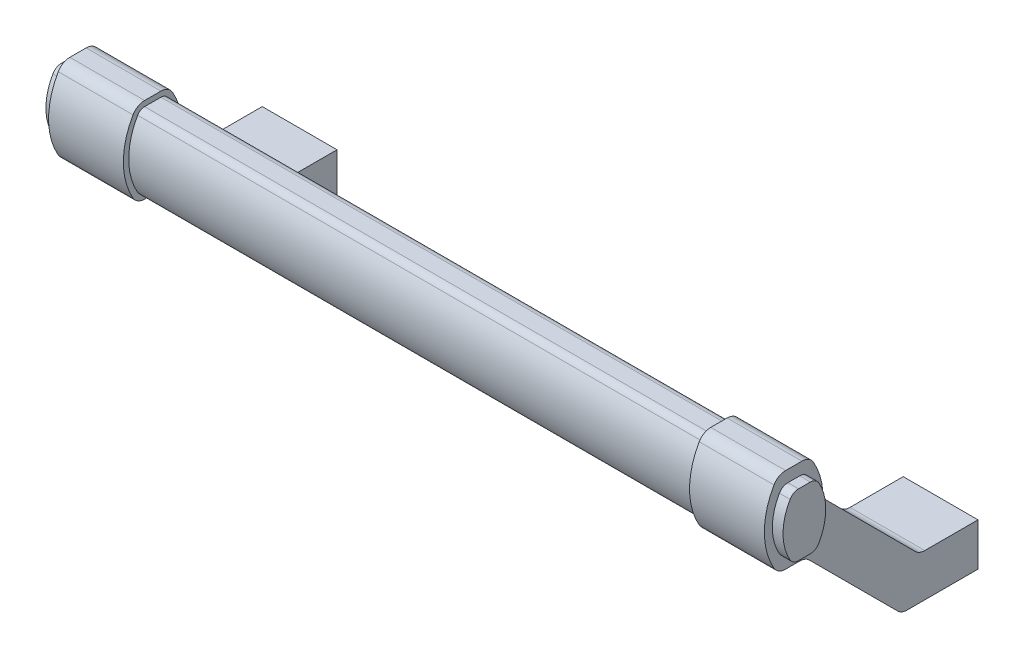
ISO-10303-21;
HEADER;
FILE_DESCRIPTION(('STEP AP214'),'2;1');
FILE_NAME('part.step','',(''),(''),'','','');
FILE_SCHEMA(('AUTOMOTIVE_DESIGN { 1 0 10303 214 1 1 1 1 }'));
ENDSEC;
DATA;
#1=APPLICATION_CONTEXT('core data for automotive mechanical design processes');
#2=APPLICATION_PROTOCOL_DEFINITION('international standard','automotive_design',2000,#1);
#3=PRODUCT_CONTEXT('',#1,'mechanical');
#4=PRODUCT('Part','Part','',(#3));
#5=PRODUCT_RELATED_PRODUCT_CATEGORY('part','',(#4));
#6=PRODUCT_DEFINITION_FORMATION('','',#4);
#7=PRODUCT_DEFINITION_CONTEXT('part definition',#1,'design');
#8=PRODUCT_DEFINITION('design','',#6,#7);
#9=PRODUCT_DEFINITION_SHAPE('','',#8);
#10=(LENGTH_UNIT() NAMED_UNIT(*) SI_UNIT(.MILLI.,.METRE.));
#11=(NAMED_UNIT(*) PLANE_ANGLE_UNIT() SI_UNIT($,.RADIAN.));
#12=(NAMED_UNIT(*) SI_UNIT($,.STERADIAN.) SOLID_ANGLE_UNIT());
#13=UNCERTAINTY_MEASURE_WITH_UNIT(LENGTH_MEASURE(1.E-05),#10,'distance_accuracy_value','');
#14=(GEOMETRIC_REPRESENTATION_CONTEXT(3) GLOBAL_UNCERTAINTY_ASSIGNED_CONTEXT((#13)) GLOBAL_UNIT_ASSIGNED_CONTEXT((#10,
#11,#12)) REPRESENTATION_CONTEXT('',''));
#15=CARTESIAN_POINT('',(0.,0.,0.));
#16=DIRECTION('',(0.,0.,1.));
#17=DIRECTION('',(1.,0.,0.));
#18=AXIS2_PLACEMENT_3D('',#15,#16,#17);
#19=CARTESIAN_POINT('',(-7.,4.,0.));
#20=DIRECTION('',(0.,0.,1.));
#21=DIRECTION('',(-1.,0.,0.));
#22=AXIS2_PLACEMENT_3D('',#19,#20,#21);
#23=PLANE('',#22);
#24=CARTESIAN_POINT('',(0.,0.,0.));
#25=DIRECTION('',(0.,0.,-1.));
#26=DIRECTION('',(1.,0.,0.));
#27=AXIS2_PLACEMENT_3D('',#24,#25,#26);
#28=CIRCLE('',#27,2.5);
#29=CARTESIAN_POINT('',(2.5,0.,0.));
#30=VERTEX_POINT('',#29);
#31=EDGE_CURVE('E610',#30,#30,#28,.T.);
#32=ORIENTED_EDGE('',*,*,#31,.F.);
#33=EDGE_LOOP('',(#32));
#34=FACE_BOUND('',#33,.T.);
#35=DIRECTION('',(1.,0.,0.));
#36=VECTOR('',#35,1.);
#37=CARTESIAN_POINT('',(-7.,-4.,0.));
#38=LINE('',#37,#36);
#39=CARTESIAN_POINT('',(-7.,-4.,0.));
#40=VERTEX_POINT('',#39);
#41=CARTESIAN_POINT('',(7.,-4.,0.));
#42=VERTEX_POINT('',#41);
#43=EDGE_CURVE('E9',#40,#42,#38,.T.);
#44=ORIENTED_EDGE('',*,*,#43,.F.);
#45=DIRECTION('',(0.,-1.,0.));
#46=VECTOR('',#45,1.);
#47=CARTESIAN_POINT('',(-7.,4.,0.));
#48=LINE('',#47,#46);
#49=CARTESIAN_POINT('',(-7.,4.,0.));
#50=VERTEX_POINT('',#49);
#51=EDGE_CURVE('E763',#50,#40,#48,.T.);
#52=ORIENTED_EDGE('',*,*,#51,.F.);
#53=DIRECTION('',(1.,0.,0.));
#54=VECTOR('',#53,1.);
#55=CARTESIAN_POINT('',(-7.,4.,0.));
#56=LINE('',#55,#54);
#57=CARTESIAN_POINT('',(7.,4.,0.));
#58=VERTEX_POINT('',#57);
#59=EDGE_CURVE('E811',#50,#58,#56,.T.);
#60=ORIENTED_EDGE('',*,*,#59,.T.);
#61=DIRECTION('',(0.,-1.,0.));
#62=VECTOR('',#61,1.);
#63=CARTESIAN_POINT('',(7.,4.,0.));
#64=LINE('',#63,#62);
#65=EDGE_CURVE('E715',#58,#42,#64,.T.);
#66=ORIENTED_EDGE('',*,*,#65,.T.);
#67=EDGE_LOOP('',(#44,#52,#60,#66));
#68=FACE_BOUND('',#67,.T.);
#69=ADVANCED_FACE('F14',(#34,#68),#23,.F.);
#70=CARTESIAN_POINT('',(-7.,-4.,0.));
#71=DIRECTION('',(0.,1.,0.));
#72=DIRECTION('',(-1.,0.,0.));
#73=AXIS2_PLACEMENT_3D('',#70,#71,#72);
#74=PLANE('',#73);
#75=DIRECTION('',(1.,0.,0.));
#76=VECTOR('',#75,1.);
#77=CARTESIAN_POINT('',(-7.,-4.,13.278174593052));
#78=LINE('',#77,#76);
#79=CARTESIAN_POINT('',(-7.,-4.,13.278174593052));
#80=VERTEX_POINT('',#79);
#81=CARTESIAN_POINT('',(7.,-4.,13.278174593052));
#82=VERTEX_POINT('',#81);
#83=EDGE_CURVE('E22',#80,#82,#78,.T.);
#84=ORIENTED_EDGE('',*,*,#83,.F.);
#85=DIRECTION('',(0.,0.,1.));
#86=VECTOR('',#85,1.);
#87=CARTESIAN_POINT('',(-7.,-4.,0.));
#88=LINE('',#87,#86);
#89=EDGE_CURVE('E766',#40,#80,#88,.T.);
#90=ORIENTED_EDGE('',*,*,#89,.F.);
#91=ORIENTED_EDGE('',*,*,#43,.T.);
#92=DIRECTION('',(0.,0.,1.));
#93=VECTOR('',#92,1.);
#94=CARTESIAN_POINT('',(7.,-4.,0.));
#95=LINE('',#94,#93);
#96=EDGE_CURVE('E718',#42,#82,#95,.T.);
#97=ORIENTED_EDGE('',*,*,#96,.T.);
#98=EDGE_LOOP('',(#84,#90,#91,#97));
#99=FACE_BOUND('',#98,.T.);
#100=ADVANCED_FACE('F16',(#99),#74,.F.);
#101=CARTESIAN_POINT('',(-7.,-1.5,13.278174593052));
#102=DIRECTION('',(1.,0.,0.));
#103=DIRECTION('',(0.,1.,0.));
#104=AXIS2_PLACEMENT_3D('',#101,#102,#103);
#105=CYLINDRICAL_SURFACE('',#104,2.49999999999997);
#106=DIRECTION('',(1.,0.,0.));
#107=VECTOR('',#106,1.);
#108=CARTESIAN_POINT('',(-7.,-3.26776695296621,15.0459415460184));
#109=LINE('',#108,#107);
#110=CARTESIAN_POINT('',(-7.,-3.26776695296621,15.0459415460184));
#111=VERTEX_POINT('',#110);
#112=CARTESIAN_POINT('',(7.,-3.26776695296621,15.0459415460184));
#113=VERTEX_POINT('',#112);
#114=EDGE_CURVE('E837',#111,#113,#109,.T.);
#115=ORIENTED_EDGE('',*,*,#114,.F.);
#116=CARTESIAN_POINT('',(-7.,-1.5,13.278174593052));
#117=DIRECTION('',(-1.,0.,0.));
#118=DIRECTION('',(0.,-1.,0.));
#119=AXIS2_PLACEMENT_3D('',#116,#117,#118);
#120=CIRCLE('',#119,2.49999999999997);
#121=EDGE_CURVE('E769',#80,#111,#120,.T.);
#122=ORIENTED_EDGE('',*,*,#121,.F.);
#123=ORIENTED_EDGE('',*,*,#83,.T.);
#124=CARTESIAN_POINT('',(7.,-1.5,13.278174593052));
#125=DIRECTION('',(-1.,0.,0.));
#126=DIRECTION('',(0.,-1.,0.));
#127=AXIS2_PLACEMENT_3D('',#124,#125,#126);
#128=CIRCLE('',#127,2.49999999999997);
#129=EDGE_CURVE('E721',#82,#113,#128,.T.);
#130=ORIENTED_EDGE('',*,*,#129,.T.);
#131=EDGE_LOOP('',(#115,#122,#123,#130));
#132=FACE_BOUND('',#131,.T.);
#133=ADVANCED_FACE('F840',(#132),#105,.T.);
#134=CARTESIAN_POINT('',(-7.,13.2677669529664,31.581475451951));
#135=DIRECTION('',(0.,-0.707106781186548,0.707106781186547));
#136=DIRECTION('',(0.,0.707106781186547,0.707106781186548));
#137=AXIS2_PLACEMENT_3D('',#134,#135,#136);
#138=PLANE('',#137);
#139=DIRECTION('',(1.,0.,0.));
#140=VECTOR('',#139,1.);
#141=CARTESIAN_POINT('',(-7.,13.2677669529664,31.581475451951));
#142=LINE('',#141,#140);
#143=CARTESIAN_POINT('',(-7.,13.2677669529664,31.581475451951));
#144=VERTEX_POINT('',#143);
#145=CARTESIAN_POINT('',(7.,13.2677669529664,31.581475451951));
#146=VERTEX_POINT('',#145);
#147=EDGE_CURVE('E835',#144,#146,#142,.T.);
#148=ORIENTED_EDGE('',*,*,#147,.F.);
#149=DIRECTION('',(0.,-0.707106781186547,-0.707106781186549));
#150=VECTOR('',#149,1.);
#151=CARTESIAN_POINT('',(-7.,13.2677669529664,31.581475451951));
#152=LINE('',#151,#150);
#153=EDGE_CURVE('E772',#144,#111,#152,.T.);
#154=ORIENTED_EDGE('',*,*,#153,.T.);
#155=ORIENTED_EDGE('',*,*,#114,.T.);
#156=DIRECTION('',(0.,-0.707106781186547,-0.707106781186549));
#157=VECTOR('',#156,1.);
#158=CARTESIAN_POINT('',(7.,13.2677669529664,31.581475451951));
#159=LINE('',#158,#157);
#160=EDGE_CURVE('E724',#146,#113,#159,.T.);
#161=ORIENTED_EDGE('',*,*,#160,.F.);
#162=EDGE_LOOP('',(#148,#154,#155,#161));
#163=FACE_BOUND('',#162,.T.);
#164=ADVANCED_FACE('F852',(#163),#138,.T.);
#165=CARTESIAN_POINT('',(-7.,11.5,33.3492424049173));
#166=DIRECTION('',(1.,0.,0.));
#167=DIRECTION('',(0.,1.,0.));
#168=AXIS2_PLACEMENT_3D('',#165,#166,#167);
#169=CYLINDRICAL_SURFACE('',#168,2.5);
#170=DIRECTION('',(1.,0.,0.));
#171=VECTOR('',#170,1.);
#172=CARTESIAN_POINT('',(-7.,14.,33.3492424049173));
#173=LINE('',#172,#171);
#174=CARTESIAN_POINT('',(-7.,14.,33.3492424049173));
#175=VERTEX_POINT('',#174);
#176=CARTESIAN_POINT('',(7.,14.,33.3492424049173));
#177=VERTEX_POINT('',#176);
#178=EDGE_CURVE('E833',#175,#177,#173,.T.);
#179=ORIENTED_EDGE('',*,*,#178,.F.);
#180=CARTESIAN_POINT('',(-7.,11.5,33.3492424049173));
#181=DIRECTION('',(-1.,0.,0.));
#182=DIRECTION('',(0.,-1.,0.));
#183=AXIS2_PLACEMENT_3D('',#180,#181,#182);
#184=CIRCLE('',#183,2.5);
#185=EDGE_CURVE('E775',#175,#144,#184,.T.);
#186=ORIENTED_EDGE('',*,*,#185,.T.);
#187=ORIENTED_EDGE('',*,*,#147,.T.);
#188=CARTESIAN_POINT('',(7.,11.5,33.3492424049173));
#189=DIRECTION('',(-1.,0.,0.));
#190=DIRECTION('',(0.,-1.,0.));
#191=AXIS2_PLACEMENT_3D('',#188,#189,#190);
#192=CIRCLE('',#191,2.5);
#193=EDGE_CURVE('E727',#177,#146,#192,.T.);
#194=ORIENTED_EDGE('',*,*,#193,.F.);
#195=EDGE_LOOP('',(#179,#186,#187,#194));
#196=FACE_BOUND('',#195,.T.);
#197=ADVANCED_FACE('F903',(#196),#169,.F.);
#198=CARTESIAN_POINT('',(-7.,14.,33.3492424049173));
#199=DIRECTION('',(0.,1.,0.));
#200=DIRECTION('',(-1.,0.,0.));
#201=AXIS2_PLACEMENT_3D('',#198,#199,#200);
#202=PLANE('',#201);
#203=DIRECTION('',(1.,0.,0.));
#204=VECTOR('',#203,1.);
#205=CARTESIAN_POINT('',(-7.,14.,36.0262794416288));
#206=LINE('',#205,#204);
#207=CARTESIAN_POINT('',(-7.,14.,36.0262794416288));
#208=VERTEX_POINT('',#207);
#209=CARTESIAN_POINT('',(7.,14.,36.0262794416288));
#210=VERTEX_POINT('',#209);
#211=EDGE_CURVE('E831',#208,#210,#206,.T.);
#212=ORIENTED_EDGE('',*,*,#211,.F.);
#213=DIRECTION('',(0.,0.,1.));
#214=VECTOR('',#213,1.);
#215=CARTESIAN_POINT('',(-7.,14.,33.3492424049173));
#216=LINE('',#215,#214);
#217=EDGE_CURVE('E778',#175,#208,#216,.T.);
#218=ORIENTED_EDGE('',*,*,#217,.F.);
#219=ORIENTED_EDGE('',*,*,#178,.T.);
#220=DIRECTION('',(0.,0.,1.));
#221=VECTOR('',#220,1.);
#222=CARTESIAN_POINT('',(7.,14.,33.3492424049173));
#223=LINE('',#222,#221);
#224=EDGE_CURVE('E730',#177,#210,#223,.T.);
#225=ORIENTED_EDGE('',*,*,#224,.T.);
#226=EDGE_LOOP('',(#212,#218,#219,#225));
#227=FACE_BOUND('',#226,.T.);
#228=ADVANCED_FACE('F901',(#227),#202,.F.);
#229=CARTESIAN_POINT('',(-7.,16.5,36.0262794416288));
#230=DIRECTION('',(1.,0.,0.));
#231=DIRECTION('',(0.,1.,0.));
#232=AXIS2_PLACEMENT_3D('',#229,#230,#231);
#233=CYLINDRICAL_SURFACE('',#232,2.5);
#234=DIRECTION('',(1.,0.,0.));
#235=VECTOR('',#234,1.);
#236=CARTESIAN_POINT('',(-7.,15.25,38.1913429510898));
#237=LINE('',#236,#235);
#238=CARTESIAN_POINT('',(-7.,15.25,38.1913429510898));
#239=VERTEX_POINT('',#238);
#240=CARTESIAN_POINT('',(7.,15.25,38.1913429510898));
#241=VERTEX_POINT('',#240);
#242=EDGE_CURVE('E829',#239,#241,#237,.T.);
#243=ORIENTED_EDGE('',*,*,#242,.F.);
#244=CARTESIAN_POINT('',(-7.,16.5,36.0262794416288));
#245=DIRECTION('',(-1.,0.,0.));
#246=DIRECTION('',(0.,-1.,0.));
#247=AXIS2_PLACEMENT_3D('',#244,#245,#246);
#248=CIRCLE('',#247,2.5);
#249=EDGE_CURVE('E781',#208,#239,#248,.T.);
#250=ORIENTED_EDGE('',*,*,#249,.F.);
#251=ORIENTED_EDGE('',*,*,#211,.T.);
#252=CARTESIAN_POINT('',(7.,16.5,36.0262794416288));
#253=DIRECTION('',(-1.,0.,0.));
#254=DIRECTION('',(0.,-1.,0.));
#255=AXIS2_PLACEMENT_3D('',#252,#253,#254);
#256=CIRCLE('',#255,2.5);
#257=EDGE_CURVE('E733',#210,#241,#256,.T.);
#258=ORIENTED_EDGE('',*,*,#257,.T.);
#259=EDGE_LOOP('',(#243,#250,#251,#258));
#260=FACE_BOUND('',#259,.T.);
#261=ADVANCED_FACE('F898',(#260),#233,.T.);
#262=CARTESIAN_POINT('',(-7.,22.,26.5));
#263=DIRECTION('',(1.,0.,0.));
#264=DIRECTION('',(0.,1.,0.));
#265=AXIS2_PLACEMENT_3D('',#262,#263,#264);
#266=CYLINDRICAL_SURFACE('',#265,13.5);
#267=DIRECTION('',(1.,0.,0.));
#268=VECTOR('',#267,1.);
#269=CARTESIAN_POINT('',(-7.,28.75,38.1913429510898));
#270=LINE('',#269,#268);
#271=CARTESIAN_POINT('',(-7.,28.75,38.1913429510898));
#272=VERTEX_POINT('',#271);
#273=CARTESIAN_POINT('',(7.,28.75,38.1913429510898));
#274=VERTEX_POINT('',#273);
#275=EDGE_CURVE('E827',#272,#274,#270,.T.);
#276=ORIENTED_EDGE('',*,*,#275,.F.);
#277=CARTESIAN_POINT('',(-7.,22.,26.5));
#278=DIRECTION('',(-1.,0.,0.));
#279=DIRECTION('',(0.,-1.,0.));
#280=AXIS2_PLACEMENT_3D('',#277,#278,#279);
#281=CIRCLE('',#280,13.5);
#282=EDGE_CURVE('E784',#239,#272,#281,.T.);
#283=ORIENTED_EDGE('',*,*,#282,.F.);
#284=ORIENTED_EDGE('',*,*,#242,.T.);
#285=CARTESIAN_POINT('',(7.,22.,26.5));
#286=DIRECTION('',(-1.,0.,0.));
#287=DIRECTION('',(0.,-1.,0.));
#288=AXIS2_PLACEMENT_3D('',#285,#286,#287);
#289=CIRCLE('',#288,13.5);
#290=EDGE_CURVE('E736',#241,#274,#289,.T.);
#291=ORIENTED_EDGE('',*,*,#290,.T.);
#292=EDGE_LOOP('',(#276,#283,#284,#291));
#293=FACE_BOUND('',#292,.T.);
#294=ADVANCED_FACE('F894',(#293),#266,.T.);
#295=CARTESIAN_POINT('',(-7.,27.5,36.0262794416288));
#296=DIRECTION('',(1.,0.,0.));
#297=DIRECTION('',(0.,1.,0.));
#298=AXIS2_PLACEMENT_3D('',#295,#296,#297);
#299=CYLINDRICAL_SURFACE('',#298,2.5);
#300=DIRECTION('',(1.,0.,0.));
#301=VECTOR('',#300,1.);
#302=CARTESIAN_POINT('',(-7.,30.,36.0262794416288));
#303=LINE('',#302,#301);
#304=CARTESIAN_POINT('',(-7.,30.,36.0262794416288));
#305=VERTEX_POINT('',#304);
#306=CARTESIAN_POINT('',(7.,30.,36.0262794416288));
#307=VERTEX_POINT('',#306);
#308=EDGE_CURVE('E825',#305,#307,#303,.T.);
#309=ORIENTED_EDGE('',*,*,#308,.F.);
#310=CARTESIAN_POINT('',(-7.,27.5,36.0262794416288));
#311=DIRECTION('',(-1.,0.,0.));
#312=DIRECTION('',(0.,-1.,0.));
#313=AXIS2_PLACEMENT_3D('',#310,#311,#312);
#314=CIRCLE('',#313,2.5);
#315=EDGE_CURVE('E787',#272,#305,#314,.T.);
#316=ORIENTED_EDGE('',*,*,#315,.F.);
#317=ORIENTED_EDGE('',*,*,#275,.T.);
#318=CARTESIAN_POINT('',(7.,27.5,36.0262794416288));
#319=DIRECTION('',(-1.,0.,0.));
#320=DIRECTION('',(0.,-1.,0.));
#321=AXIS2_PLACEMENT_3D('',#318,#319,#320);
#322=CIRCLE('',#321,2.5);
#323=EDGE_CURVE('E739',#274,#307,#322,.T.);
#324=ORIENTED_EDGE('',*,*,#323,.T.);
#325=EDGE_LOOP('',(#309,#316,#317,#324));
#326=FACE_BOUND('',#325,.T.);
#327=ADVANCED_FACE('F890',(#326),#299,.T.);
#328=CARTESIAN_POINT('',(-7.,30.,32.9737205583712));
#329=DIRECTION('',(0.,1.,0.));
#330=DIRECTION('',(-1.,0.,0.));
#331=AXIS2_PLACEMENT_3D('',#328,#329,#330);
#332=PLANE('',#331);
#333=DIRECTION('',(1.,0.,0.));
#334=VECTOR('',#333,1.);
#335=CARTESIAN_POINT('',(-7.,30.,32.9737205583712));
#336=LINE('',#335,#334);
#337=CARTESIAN_POINT('',(-7.,30.,32.9737205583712));
#338=VERTEX_POINT('',#337);
#339=CARTESIAN_POINT('',(7.,30.,32.9737205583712));
#340=VERTEX_POINT('',#339);
#341=EDGE_CURVE('E823',#338,#340,#336,.T.);
#342=ORIENTED_EDGE('',*,*,#341,.F.);
#343=DIRECTION('',(0.,0.,1.));
#344=VECTOR('',#343,1.);
#345=CARTESIAN_POINT('',(-7.,30.,32.9737205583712));
#346=LINE('',#345,#344);
#347=EDGE_CURVE('E790',#338,#305,#346,.T.);
#348=ORIENTED_EDGE('',*,*,#347,.T.);
#349=ORIENTED_EDGE('',*,*,#308,.T.);
#350=DIRECTION('',(0.,0.,1.));
#351=VECTOR('',#350,1.);
#352=CARTESIAN_POINT('',(7.,30.,32.9737205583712));
#353=LINE('',#352,#351);
#354=EDGE_CURVE('E742',#340,#307,#353,.T.);
#355=ORIENTED_EDGE('',*,*,#354,.F.);
#356=EDGE_LOOP('',(#342,#348,#349,#355));
#357=FACE_BOUND('',#356,.T.);
#358=ADVANCED_FACE('F887',(#357),#332,.T.);
#359=CARTESIAN_POINT('',(-7.,27.5,32.9737205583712));
#360=DIRECTION('',(1.,0.,0.));
#361=DIRECTION('',(0.,1.,0.));
#362=AXIS2_PLACEMENT_3D('',#359,#360,#361);
#363=CYLINDRICAL_SURFACE('',#362,2.5);
#364=DIRECTION('',(1.,0.,0.));
#365=VECTOR('',#364,1.);
#366=CARTESIAN_POINT('',(-7.,28.75,30.80865704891));
#367=LINE('',#366,#365);
#368=CARTESIAN_POINT('',(-7.,28.75,30.80865704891));
#369=VERTEX_POINT('',#368);
#370=CARTESIAN_POINT('',(7.,28.75,30.80865704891));
#371=VERTEX_POINT('',#370);
#372=EDGE_CURVE('E821',#369,#371,#367,.T.);
#373=ORIENTED_EDGE('',*,*,#372,.F.);
#374=CARTESIAN_POINT('',(-7.,27.5,32.9737205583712));
#375=DIRECTION('',(-1.,0.,0.));
#376=DIRECTION('',(0.,-1.,0.));
#377=AXIS2_PLACEMENT_3D('',#374,#375,#376);
#378=CIRCLE('',#377,2.5);
#379=EDGE_CURVE('E793',#338,#369,#378,.T.);
#380=ORIENTED_EDGE('',*,*,#379,.F.);
#381=ORIENTED_EDGE('',*,*,#341,.T.);
#382=CARTESIAN_POINT('',(7.,27.5,32.9737205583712));
#383=DIRECTION('',(-1.,0.,0.));
#384=DIRECTION('',(0.,-1.,0.));
#385=AXIS2_PLACEMENT_3D('',#382,#383,#384);
#386=CIRCLE('',#385,2.5);
#387=EDGE_CURVE('E745',#340,#371,#386,.T.);
#388=ORIENTED_EDGE('',*,*,#387,.T.);
#389=EDGE_LOOP('',(#373,#380,#381,#388));
#390=FACE_BOUND('',#389,.T.);
#391=ADVANCED_FACE('F883',(#390),#363,.T.);
#392=CARTESIAN_POINT('',(-7.,22.,42.5));
#393=DIRECTION('',(1.,0.,0.));
#394=DIRECTION('',(0.,1.,0.));
#395=AXIS2_PLACEMENT_3D('',#392,#393,#394);
#396=CYLINDRICAL_SURFACE('',#395,13.5);
#397=DIRECTION('',(1.,0.,0.));
#398=VECTOR('',#397,1.);
#399=CARTESIAN_POINT('',(-7.,22.9040353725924,29.0303036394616));
#400=LINE('',#399,#398);
#401=CARTESIAN_POINT('',(-7.,22.9040353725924,29.0303036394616));
#402=VERTEX_POINT('',#401);
#403=CARTESIAN_POINT('',(7.,22.9040353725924,29.0303036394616));
#404=VERTEX_POINT('',#403);
#405=EDGE_CURVE('E819',#402,#404,#400,.T.);
#406=ORIENTED_EDGE('',*,*,#405,.F.);
#407=CARTESIAN_POINT('',(-7.,22.,42.5));
#408=DIRECTION('',(-1.,0.,0.));
#409=DIRECTION('',(0.,-1.,0.));
#410=AXIS2_PLACEMENT_3D('',#407,#408,#409);
#411=CIRCLE('',#410,13.5);
#412=EDGE_CURVE('E796',#369,#402,#411,.T.);
#413=ORIENTED_EDGE('',*,*,#412,.F.);
#414=ORIENTED_EDGE('',*,*,#372,.T.);
#415=CARTESIAN_POINT('',(7.,22.,42.5));
#416=DIRECTION('',(-1.,0.,0.));
#417=DIRECTION('',(0.,-1.,0.));
#418=AXIS2_PLACEMENT_3D('',#415,#416,#417);
#419=CIRCLE('',#418,13.5);
#420=EDGE_CURVE('E748',#371,#404,#419,.T.);
#421=ORIENTED_EDGE('',*,*,#420,.T.);
#422=EDGE_LOOP('',(#406,#413,#414,#421));
#423=FACE_BOUND('',#422,.T.);
#424=ADVANCED_FACE('F878',(#423),#396,.T.);
#425=CARTESIAN_POINT('',(-7.,23.0714493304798,26.535915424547));
#426=DIRECTION('',(1.,0.,0.));
#427=DIRECTION('',(0.,1.,0.));
#428=AXIS2_PLACEMENT_3D('',#425,#426,#427);
#429=CYLINDRICAL_SURFACE('',#428,2.5);
#430=DIRECTION('',(1.,0.,0.));
#431=VECTOR('',#430,1.);
#432=CARTESIAN_POINT('',(-7.,21.3036823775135,28.3036823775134));
#433=LINE('',#432,#431);
#434=CARTESIAN_POINT('',(-7.,21.3036823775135,28.3036823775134));
#435=VERTEX_POINT('',#434);
#436=CARTESIAN_POINT('',(7.,21.3036823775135,28.3036823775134));
#437=VERTEX_POINT('',#436);
#438=EDGE_CURVE('E817',#435,#437,#433,.T.);
#439=ORIENTED_EDGE('',*,*,#438,.F.);
#440=CARTESIAN_POINT('',(-7.,23.0714493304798,26.535915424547));
#441=DIRECTION('',(-1.,0.,0.));
#442=DIRECTION('',(0.,-1.,0.));
#443=AXIS2_PLACEMENT_3D('',#440,#441,#442);
#444=CIRCLE('',#443,2.5);
#445=EDGE_CURVE('E799',#435,#402,#444,.T.);
#446=ORIENTED_EDGE('',*,*,#445,.T.);
#447=ORIENTED_EDGE('',*,*,#405,.T.);
#448=CARTESIAN_POINT('',(7.,23.0714493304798,26.535915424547));
#449=DIRECTION('',(-1.,0.,0.));
#450=DIRECTION('',(0.,-1.,0.));
#451=AXIS2_PLACEMENT_3D('',#448,#449,#450);
#452=CIRCLE('',#451,2.5);
#453=EDGE_CURVE('E751',#437,#404,#452,.T.);
#454=ORIENTED_EDGE('',*,*,#453,.F.);
#455=EDGE_LOOP('',(#439,#446,#447,#454));
#456=FACE_BOUND('',#455,.T.);
#457=ADVANCED_FACE('F875',(#456),#429,.F.);
#458=CARTESIAN_POINT('',(-7.,21.3036823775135,28.3036823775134));
#459=DIRECTION('',(0.,-0.707106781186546,0.707106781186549));
#460=DIRECTION('',(0.,0.707106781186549,0.707106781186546));
#461=AXIS2_PLACEMENT_3D('',#458,#459,#460);
#462=PLANE('',#461);
#463=DIRECTION('',(1.,0.,0.));
#464=VECTOR('',#463,1.);
#465=CARTESIAN_POINT('',(-7.,4.7322330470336,11.7322330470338));
#466=LINE('',#465,#464);
#467=CARTESIAN_POINT('',(-7.,4.7322330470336,11.7322330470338));
#468=VERTEX_POINT('',#467);
#469=CARTESIAN_POINT('',(7.,4.7322330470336,11.7322330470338));
#470=VERTEX_POINT('',#469);
#471=EDGE_CURVE('E815',#468,#470,#466,.T.);
#472=ORIENTED_EDGE('',*,*,#471,.F.);
#473=DIRECTION('',(0.,-0.707106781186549,-0.707106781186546));
#474=VECTOR('',#473,1.);
#475=CARTESIAN_POINT('',(-7.,21.3036823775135,28.3036823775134));
#476=LINE('',#475,#474);
#477=EDGE_CURVE('E802',#435,#468,#476,.T.);
#478=ORIENTED_EDGE('',*,*,#477,.F.);
#479=ORIENTED_EDGE('',*,*,#438,.T.);
#480=DIRECTION('',(0.,-0.707106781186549,-0.707106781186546));
#481=VECTOR('',#480,1.);
#482=CARTESIAN_POINT('',(7.,21.3036823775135,28.3036823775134));
#483=LINE('',#482,#481);
#484=EDGE_CURVE('E754',#437,#470,#483,.T.);
#485=ORIENTED_EDGE('',*,*,#484,.T.);
#486=EDGE_LOOP('',(#472,#478,#479,#485));
#487=FACE_BOUND('',#486,.T.);
#488=ADVANCED_FACE('F871',(#487),#462,.F.);
#489=CARTESIAN_POINT('',(-7.,6.5,9.9644660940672));
#490=DIRECTION('',(1.,0.,0.));
#491=DIRECTION('',(0.,1.,0.));
#492=AXIS2_PLACEMENT_3D('',#489,#490,#491);
#493=CYLINDRICAL_SURFACE('',#492,2.5);
#494=DIRECTION('',(1.,0.,0.));
#495=VECTOR('',#494,1.);
#496=CARTESIAN_POINT('',(-7.,4.,9.9644660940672));
#497=LINE('',#496,#495);
#498=CARTESIAN_POINT('',(-7.,4.,9.9644660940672));
#499=VERTEX_POINT('',#498);
#500=CARTESIAN_POINT('',(7.,4.,9.9644660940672));
#501=VERTEX_POINT('',#500);
#502=EDGE_CURVE('E813',#499,#501,#497,.T.);
#503=ORIENTED_EDGE('',*,*,#502,.F.);
#504=CARTESIAN_POINT('',(-7.,6.5,9.9644660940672));
#505=DIRECTION('',(-1.,0.,0.));
#506=DIRECTION('',(0.,-1.,0.));
#507=AXIS2_PLACEMENT_3D('',#504,#505,#506);
#508=CIRCLE('',#507,2.5);
#509=EDGE_CURVE('E805',#499,#468,#508,.T.);
#510=ORIENTED_EDGE('',*,*,#509,.T.);
#511=ORIENTED_EDGE('',*,*,#471,.T.);
#512=CARTESIAN_POINT('',(7.,6.5,9.9644660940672));
#513=DIRECTION('',(-1.,0.,0.));
#514=DIRECTION('',(0.,-1.,0.));
#515=AXIS2_PLACEMENT_3D('',#512,#513,#514);
#516=CIRCLE('',#515,2.5);
#517=EDGE_CURVE('E757',#501,#470,#516,.T.);
#518=ORIENTED_EDGE('',*,*,#517,.F.);
#519=EDGE_LOOP('',(#503,#510,#511,#518));
#520=FACE_BOUND('',#519,.T.);
#521=ADVANCED_FACE('F866',(#520),#493,.F.);
#522=CARTESIAN_POINT('',(-7.,4.,0.));
#523=DIRECTION('',(0.,1.,0.));
#524=DIRECTION('',(-1.,0.,0.));
#525=AXIS2_PLACEMENT_3D('',#522,#523,#524);
#526=PLANE('',#525);
#527=DIRECTION('',(0.,0.,1.));
#528=VECTOR('',#527,1.);
#529=CARTESIAN_POINT('',(-7.,4.,0.));
#530=LINE('',#529,#528);
#531=EDGE_CURVE('E808',#50,#499,#530,.T.);
#532=ORIENTED_EDGE('',*,*,#531,.T.);
#533=ORIENTED_EDGE('',*,*,#502,.T.);
#534=DIRECTION('',(0.,0.,1.));
#535=VECTOR('',#534,1.);
#536=CARTESIAN_POINT('',(7.,4.,0.));
#537=LINE('',#536,#535);
#538=EDGE_CURVE('E760',#58,#501,#537,.T.);
#539=ORIENTED_EDGE('',*,*,#538,.F.);
#540=ORIENTED_EDGE('',*,*,#59,.F.);
#541=EDGE_LOOP('',(#532,#533,#539,#540));
#542=FACE_BOUND('',#541,.T.);
#543=ADVANCED_FACE('F863',(#542),#526,.T.);
#544=CARTESIAN_POINT('',(-7.,-1.5,13.278174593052));
#545=DIRECTION('',(-1.,0.,0.));
#546=DIRECTION('',(0.,-1.,0.));
#547=AXIS2_PLACEMENT_3D('',#544,#545,#546);
#548=PLANE('',#547);
#549=CARTESIAN_POINT('',(-7.,18.,35.6100214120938));
#550=DIRECTION('',(-1.,0.,0.));
#551=DIRECTION('',(0.,-1.,0.));
#552=AXIS2_PLACEMENT_3D('',#549,#550,#551);
#553=CIRCLE('',#552,1.81818181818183);
#554=CARTESIAN_POINT('',(-7.,16.1818181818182,35.6100214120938));
#555=VERTEX_POINT('',#554);
#556=CARTESIAN_POINT('',(-7.,17.0909090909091,37.1846130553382));
#557=VERTEX_POINT('',#556);
#558=EDGE_CURVE('E37',#555,#557,#553,.T.);
#559=ORIENTED_EDGE('',*,*,#558,.F.);
#560=DIRECTION('',(0.,0.,1.));
#561=VECTOR('',#560,1.);
#562=CARTESIAN_POINT('',(-7.,16.1818181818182,33.3899785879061));
#563=LINE('',#562,#561);
#564=CARTESIAN_POINT('',(-7.,16.1818181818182,33.3899785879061));
#565=VERTEX_POINT('',#564);
#566=EDGE_CURVE('E665',#565,#555,#563,.T.);
#567=ORIENTED_EDGE('',*,*,#566,.F.);
#568=CARTESIAN_POINT('',(-7.,18.,33.3899785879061));
#569=DIRECTION('',(-1.,0.,0.));
#570=DIRECTION('',(0.,-1.,0.));
#571=AXIS2_PLACEMENT_3D('',#568,#569,#570);
#572=CIRCLE('',#571,1.81818181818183);
#573=CARTESIAN_POINT('',(-7.,17.0909090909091,31.8153869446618));
#574=VERTEX_POINT('',#573);
#575=EDGE_CURVE('E662',#574,#565,#572,.T.);
#576=ORIENTED_EDGE('',*,*,#575,.F.);
#577=CARTESIAN_POINT('',(-7.,22.,40.3181818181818));
#578=DIRECTION('',(-1.,0.,0.));
#579=DIRECTION('',(0.,-1.,0.));
#580=AXIS2_PLACEMENT_3D('',#577,#578,#579);
#581=CIRCLE('',#580,9.81818181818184);
#582=CARTESIAN_POINT('',(-7.,26.9090909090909,31.8153869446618));
#583=VERTEX_POINT('',#582);
#584=EDGE_CURVE('E659',#583,#574,#581,.T.);
#585=ORIENTED_EDGE('',*,*,#584,.F.);
#586=CARTESIAN_POINT('',(-7.,26.,33.3899785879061));
#587=DIRECTION('',(-1.,0.,0.));
#588=DIRECTION('',(0.,-1.,0.));
#589=AXIS2_PLACEMENT_3D('',#586,#587,#588);
#590=CIRCLE('',#589,1.81818181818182);
#591=CARTESIAN_POINT('',(-7.,27.8181818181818,33.3899785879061));
#592=VERTEX_POINT('',#591);
#593=EDGE_CURVE('E656',#592,#583,#590,.T.);
#594=ORIENTED_EDGE('',*,*,#593,.F.);
#595=DIRECTION('',(0.,0.,1.));
#596=VECTOR('',#595,1.);
#597=CARTESIAN_POINT('',(-7.,27.8181818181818,33.3899785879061));
#598=LINE('',#597,#596);
#599=CARTESIAN_POINT('',(-7.,27.8181818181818,35.6100214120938));
#600=VERTEX_POINT('',#599);
#601=EDGE_CURVE('E654',#592,#600,#598,.T.);
#602=ORIENTED_EDGE('',*,*,#601,.T.);
#603=CARTESIAN_POINT('',(-7.,26.,35.6100214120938));
#604=DIRECTION('',(-1.,0.,0.));
#605=DIRECTION('',(0.,-1.,0.));
#606=AXIS2_PLACEMENT_3D('',#603,#604,#605);
#607=CIRCLE('',#606,1.81818181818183);
#608=CARTESIAN_POINT('',(-7.,26.9090909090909,37.1846130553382));
#609=VERTEX_POINT('',#608);
#610=EDGE_CURVE('E651',#609,#600,#607,.T.);
#611=ORIENTED_EDGE('',*,*,#610,.F.);
#612=CARTESIAN_POINT('',(-7.,22.,28.6818181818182));
#613=DIRECTION('',(-1.,0.,0.));
#614=DIRECTION('',(0.,-1.,0.));
#615=AXIS2_PLACEMENT_3D('',#612,#613,#614);
#616=CIRCLE('',#615,9.81818181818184);
#617=EDGE_CURVE('E648',#557,#609,#616,.T.);
#618=ORIENTED_EDGE('',*,*,#617,.F.);
#619=EDGE_LOOP('',(#559,#567,#576,#585,#594,#602,#611,#618));
#620=FACE_BOUND('',#619,.T.);
#621=ORIENTED_EDGE('',*,*,#51,.T.);
#622=ORIENTED_EDGE('',*,*,#89,.T.);
#623=ORIENTED_EDGE('',*,*,#121,.T.);
#624=ORIENTED_EDGE('',*,*,#153,.F.);
#625=ORIENTED_EDGE('',*,*,#185,.F.);
#626=ORIENTED_EDGE('',*,*,#217,.T.);
#627=ORIENTED_EDGE('',*,*,#249,.T.);
#628=ORIENTED_EDGE('',*,*,#282,.T.);
#629=ORIENTED_EDGE('',*,*,#315,.T.);
#630=ORIENTED_EDGE('',*,*,#347,.F.);
#631=ORIENTED_EDGE('',*,*,#379,.T.);
#632=ORIENTED_EDGE('',*,*,#412,.T.);
#633=ORIENTED_EDGE('',*,*,#445,.F.);
#634=ORIENTED_EDGE('',*,*,#477,.T.);
#635=ORIENTED_EDGE('',*,*,#509,.F.);
#636=ORIENTED_EDGE('',*,*,#531,.F.);
#637=EDGE_LOOP('',(#621,#622,#623,#624,#625,#626,#627,#628,#629,#630,#631,#632,#633,#634,#635,#636));
#638=FACE_BOUND('',#637,.T.);
#639=ADVANCED_FACE('F855',(#620,#638),#548,.T.);
#640=CARTESIAN_POINT('',(7.,-1.5,13.278174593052));
#641=DIRECTION('',(-1.,0.,0.));
#642=DIRECTION('',(0.,-1.,0.));
#643=AXIS2_PLACEMENT_3D('',#640,#641,#642);
#644=PLANE('',#643);
#645=CARTESIAN_POINT('',(7.,27.5,32.973720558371));
#646=DIRECTION('',(-1.,0.,0.));
#647=DIRECTION('',(0.,-1.,0.));
#648=AXIS2_PLACEMENT_3D('',#645,#646,#647);
#649=CIRCLE('',#648,1.5);
#650=CARTESIAN_POINT('',(7.,29.,32.9737205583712));
#651=VERTEX_POINT('',#650);
#652=CARTESIAN_POINT('',(7.,28.25,31.6746824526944));
#653=VERTEX_POINT('',#652);
#654=EDGE_CURVE('E374',#651,#653,#649,.T.);
#655=ORIENTED_EDGE('',*,*,#654,.T.);
#656=CARTESIAN_POINT('',(7.,22.,42.5));
#657=DIRECTION('',(-1.,0.,0.));
#658=DIRECTION('',(0.,-1.,0.));
#659=AXIS2_PLACEMENT_3D('',#656,#657,#658);
#660=CIRCLE('',#659,12.5);
#661=CARTESIAN_POINT('',(7.,15.75,31.6746824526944));
#662=VERTEX_POINT('',#661);
#663=EDGE_CURVE('E29',#653,#662,#660,.T.);
#664=ORIENTED_EDGE('',*,*,#663,.T.);
#665=CARTESIAN_POINT('',(7.,16.5,32.973720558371));
#666=DIRECTION('',(-1.,0.,0.));
#667=DIRECTION('',(0.,-1.,0.));
#668=AXIS2_PLACEMENT_3D('',#665,#666,#667);
#669=CIRCLE('',#668,1.49999999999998);
#670=CARTESIAN_POINT('',(7.,15.,32.973720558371));
#671=VERTEX_POINT('',#670);
#672=EDGE_CURVE('E371',#662,#671,#669,.T.);
#673=ORIENTED_EDGE('',*,*,#672,.T.);
#674=DIRECTION('',(0.,0.,1.));
#675=VECTOR('',#674,1.);
#676=CARTESIAN_POINT('',(7.,15.,32.973720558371));
#677=LINE('',#676,#675);
#678=CARTESIAN_POINT('',(7.,15.,36.0262794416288));
#679=VERTEX_POINT('',#678);
#680=EDGE_CURVE('E618',#671,#679,#677,.T.);
#681=ORIENTED_EDGE('',*,*,#680,.T.);
#682=CARTESIAN_POINT('',(7.,16.5,36.0262794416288));
#683=DIRECTION('',(1.,0.,0.));
#684=DIRECTION('',(0.,1.,0.));
#685=AXIS2_PLACEMENT_3D('',#682,#683,#684);
#686=CIRCLE('',#685,1.49999999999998);
#687=CARTESIAN_POINT('',(7.,15.75,37.3253175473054));
#688=VERTEX_POINT('',#687);
#689=EDGE_CURVE('E621',#688,#679,#686,.T.);
#690=ORIENTED_EDGE('',*,*,#689,.F.);
#691=CARTESIAN_POINT('',(7.,22.,26.5));
#692=DIRECTION('',(1.,0.,0.));
#693=DIRECTION('',(0.,1.,0.));
#694=AXIS2_PLACEMENT_3D('',#691,#692,#693);
#695=CIRCLE('',#694,12.5);
#696=CARTESIAN_POINT('',(7.,28.25,37.3253175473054));
#697=VERTEX_POINT('',#696);
#698=EDGE_CURVE('E624',#697,#688,#695,.T.);
#699=ORIENTED_EDGE('',*,*,#698,.F.);
#700=CARTESIAN_POINT('',(7.,27.5,36.0262794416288));
#701=DIRECTION('',(1.,0.,0.));
#702=DIRECTION('',(0.,1.,0.));
#703=AXIS2_PLACEMENT_3D('',#700,#701,#702);
#704=CIRCLE('',#703,1.5);
#705=CARTESIAN_POINT('',(7.,29.,36.0262794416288));
#706=VERTEX_POINT('',#705);
#707=EDGE_CURVE('E627',#706,#697,#704,.T.);
#708=ORIENTED_EDGE('',*,*,#707,.F.);
#709=DIRECTION('',(0.,0.,1.));
#710=VECTOR('',#709,1.);
#711=CARTESIAN_POINT('',(7.,29.,32.9737205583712));
#712=LINE('',#711,#710);
#713=EDGE_CURVE('E630',#651,#706,#712,.T.);
#714=ORIENTED_EDGE('',*,*,#713,.F.);
#715=EDGE_LOOP('',(#655,#664,#673,#681,#690,#699,#708,#714));
#716=FACE_BOUND('',#715,.T.);
#717=ORIENTED_EDGE('',*,*,#65,.F.);
#718=ORIENTED_EDGE('',*,*,#538,.T.);
#719=ORIENTED_EDGE('',*,*,#517,.T.);
#720=ORIENTED_EDGE('',*,*,#484,.F.);
#721=ORIENTED_EDGE('',*,*,#453,.T.);
#722=ORIENTED_EDGE('',*,*,#420,.F.);
#723=ORIENTED_EDGE('',*,*,#387,.F.);
#724=ORIENTED_EDGE('',*,*,#354,.T.);
#725=ORIENTED_EDGE('',*,*,#323,.F.);
#726=ORIENTED_EDGE('',*,*,#290,.F.);
#727=ORIENTED_EDGE('',*,*,#257,.F.);
#728=ORIENTED_EDGE('',*,*,#224,.F.);
#729=ORIENTED_EDGE('',*,*,#193,.T.);
#730=ORIENTED_EDGE('',*,*,#160,.T.);
#731=ORIENTED_EDGE('',*,*,#129,.F.);
#732=ORIENTED_EDGE('',*,*,#96,.F.);
#733=EDGE_LOOP('',(#717,#718,#719,#720,#721,#722,#723,#724,#725,#726,#727,#728,#729,#730,#731,#732));
#734=FACE_BOUND('',#733,.T.);
#735=ADVANCED_FACE('F847',(#716,#734),#644,.F.);
#736=CARTESIAN_POINT('',(-9.,18.,35.6100214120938));
#737=DIRECTION('',(1.,0.,0.));
#738=DIRECTION('',(0.,1.,0.));
#739=AXIS2_PLACEMENT_3D('',#736,#737,#738);
#740=CYLINDRICAL_SURFACE('',#739,1.81818181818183);
#741=DIRECTION('',(1.,0.,0.));
#742=VECTOR('',#741,1.);
#743=CARTESIAN_POINT('',(-9.,17.0909090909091,37.1846130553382));
#744=LINE('',#743,#742);
#745=CARTESIAN_POINT('',(-9.,17.0909090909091,37.1846130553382));
#746=VERTEX_POINT('',#745);
#747=EDGE_CURVE('E712',#746,#557,#744,.T.);
#748=ORIENTED_EDGE('',*,*,#747,.F.);
#749=CARTESIAN_POINT('',(-9.,18.,35.6100214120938));
#750=DIRECTION('',(-1.,0.,0.));
#751=DIRECTION('',(0.,-1.,0.));
#752=AXIS2_PLACEMENT_3D('',#749,#750,#751);
#753=CIRCLE('',#752,1.81818181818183);
#754=CARTESIAN_POINT('',(-9.,16.1818181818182,35.6100214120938));
#755=VERTEX_POINT('',#754);
#756=EDGE_CURVE('E668',#755,#746,#753,.T.);
#757=ORIENTED_EDGE('',*,*,#756,.F.);
#758=DIRECTION('',(1.,0.,0.));
#759=VECTOR('',#758,1.);
#760=CARTESIAN_POINT('',(-9.,16.1818181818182,35.6100214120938));
#761=LINE('',#760,#759);
#762=EDGE_CURVE('E692',#755,#555,#761,.T.);
#763=ORIENTED_EDGE('',*,*,#762,.T.);
#764=ORIENTED_EDGE('',*,*,#558,.T.);
#765=EDGE_LOOP('',(#748,#757,#763,#764));
#766=FACE_BOUND('',#765,.T.);
#767=ADVANCED_FACE('F995',(#766),#740,.T.);
#768=CARTESIAN_POINT('',(-9.,22.,28.6818181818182));
#769=DIRECTION('',(1.,0.,0.));
#770=DIRECTION('',(0.,1.,0.));
#771=AXIS2_PLACEMENT_3D('',#768,#769,#770);
#772=CYLINDRICAL_SURFACE('',#771,9.81818181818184);
#773=DIRECTION('',(1.,0.,0.));
#774=VECTOR('',#773,1.);
#775=CARTESIAN_POINT('',(-9.,26.9090909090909,37.1846130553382));
#776=LINE('',#775,#774);
#777=CARTESIAN_POINT('',(-9.,26.9090909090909,37.1846130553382));
#778=VERTEX_POINT('',#777);
#779=EDGE_CURVE('E709',#778,#609,#776,.T.);
#780=ORIENTED_EDGE('',*,*,#779,.F.);
#781=CARTESIAN_POINT('',(-9.,22.,28.6818181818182));
#782=DIRECTION('',(-1.,0.,0.));
#783=DIRECTION('',(0.,-1.,0.));
#784=AXIS2_PLACEMENT_3D('',#781,#782,#783);
#785=CIRCLE('',#784,9.81818181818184);
#786=EDGE_CURVE('E671',#746,#778,#785,.T.);
#787=ORIENTED_EDGE('',*,*,#786,.F.);
#788=ORIENTED_EDGE('',*,*,#747,.T.);
#789=ORIENTED_EDGE('',*,*,#617,.T.);
#790=EDGE_LOOP('',(#780,#787,#788,#789));
#791=FACE_BOUND('',#790,.T.);
#792=ADVANCED_FACE('F1002',(#791),#772,.T.);
#793=CARTESIAN_POINT('',(-9.,26.,35.6100214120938));
#794=DIRECTION('',(1.,0.,0.));
#795=DIRECTION('',(0.,1.,0.));
#796=AXIS2_PLACEMENT_3D('',#793,#794,#795);
#797=CYLINDRICAL_SURFACE('',#796,1.81818181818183);
#798=DIRECTION('',(1.,0.,0.));
#799=VECTOR('',#798,1.);
#800=CARTESIAN_POINT('',(-9.,27.8181818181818,35.6100214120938));
#801=LINE('',#800,#799);
#802=CARTESIAN_POINT('',(-9.,27.8181818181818,35.6100214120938));
#803=VERTEX_POINT('',#802);
#804=EDGE_CURVE('E706',#803,#600,#801,.T.);
#805=ORIENTED_EDGE('',*,*,#804,.F.);
#806=CARTESIAN_POINT('',(-9.,26.,35.6100214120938));
#807=DIRECTION('',(-1.,0.,0.));
#808=DIRECTION('',(0.,-1.,0.));
#809=AXIS2_PLACEMENT_3D('',#806,#807,#808);
#810=CIRCLE('',#809,1.81818181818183);
#811=EDGE_CURVE('E674',#778,#803,#810,.T.);
#812=ORIENTED_EDGE('',*,*,#811,.F.);
#813=ORIENTED_EDGE('',*,*,#779,.T.);
#814=ORIENTED_EDGE('',*,*,#610,.T.);
#815=EDGE_LOOP('',(#805,#812,#813,#814));
#816=FACE_BOUND('',#815,.T.);
#817=ADVANCED_FACE('F1010',(#816),#797,.T.);
#818=CARTESIAN_POINT('',(-9.,27.8181818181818,33.3899785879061));
#819=DIRECTION('',(0.,1.,0.));
#820=DIRECTION('',(-1.,0.,0.));
#821=AXIS2_PLACEMENT_3D('',#818,#819,#820);
#822=PLANE('',#821);
#823=DIRECTION('',(1.,0.,0.));
#824=VECTOR('',#823,1.);
#825=CARTESIAN_POINT('',(-9.,27.8181818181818,33.3899785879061));
#826=LINE('',#825,#824);
#827=CARTESIAN_POINT('',(-9.,27.8181818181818,33.3899785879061));
#828=VERTEX_POINT('',#827);
#829=EDGE_CURVE('E703',#828,#592,#826,.T.);
#830=ORIENTED_EDGE('',*,*,#829,.F.);
#831=DIRECTION('',(0.,0.,1.));
#832=VECTOR('',#831,1.);
#833=CARTESIAN_POINT('',(-9.,27.8181818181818,33.3899785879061));
#834=LINE('',#833,#832);
#835=EDGE_CURVE('E677',#828,#803,#834,.T.);
#836=ORIENTED_EDGE('',*,*,#835,.T.);
#837=ORIENTED_EDGE('',*,*,#804,.T.);
#838=ORIENTED_EDGE('',*,*,#601,.F.);
#839=EDGE_LOOP('',(#830,#836,#837,#838));
#840=FACE_BOUND('',#839,.T.);
#841=ADVANCED_FACE('F1018',(#840),#822,.T.);
#842=CARTESIAN_POINT('',(-9.,26.,33.3899785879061));
#843=DIRECTION('',(1.,0.,0.));
#844=DIRECTION('',(0.,1.,0.));
#845=AXIS2_PLACEMENT_3D('',#842,#843,#844);
#846=CYLINDRICAL_SURFACE('',#845,1.81818181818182);
#847=DIRECTION('',(1.,0.,0.));
#848=VECTOR('',#847,1.);
#849=CARTESIAN_POINT('',(-9.,26.9090909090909,31.8153869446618));
#850=LINE('',#849,#848);
#851=CARTESIAN_POINT('',(-9.,26.9090909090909,31.8153869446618));
#852=VERTEX_POINT('',#851);
#853=EDGE_CURVE('E700',#852,#583,#850,.T.);
#854=ORIENTED_EDGE('',*,*,#853,.F.);
#855=CARTESIAN_POINT('',(-9.,26.,33.3899785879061));
#856=DIRECTION('',(-1.,0.,0.));
#857=DIRECTION('',(0.,-1.,0.));
#858=AXIS2_PLACEMENT_3D('',#855,#856,#857);
#859=CIRCLE('',#858,1.81818181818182);
#860=EDGE_CURVE('E680',#828,#852,#859,.T.);
#861=ORIENTED_EDGE('',*,*,#860,.F.);
#862=ORIENTED_EDGE('',*,*,#829,.T.);
#863=ORIENTED_EDGE('',*,*,#593,.T.);
#864=EDGE_LOOP('',(#854,#861,#862,#863));
#865=FACE_BOUND('',#864,.T.);
#866=ADVANCED_FACE('F1026',(#865),#846,.T.);
#867=CARTESIAN_POINT('',(-9.,22.,40.3181818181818));
#868=DIRECTION('',(1.,0.,0.));
#869=DIRECTION('',(0.,1.,0.));
#870=AXIS2_PLACEMENT_3D('',#867,#868,#869);
#871=CYLINDRICAL_SURFACE('',#870,9.81818181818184);
#872=DIRECTION('',(1.,0.,0.));
#873=VECTOR('',#872,1.);
#874=CARTESIAN_POINT('',(-9.,17.0909090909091,31.8153869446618));
#875=LINE('',#874,#873);
#876=CARTESIAN_POINT('',(-9.,17.0909090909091,31.8153869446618));
#877=VERTEX_POINT('',#876);
#878=EDGE_CURVE('E697',#877,#574,#875,.T.);
#879=ORIENTED_EDGE('',*,*,#878,.F.);
#880=CARTESIAN_POINT('',(-9.,22.,40.3181818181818));
#881=DIRECTION('',(-1.,0.,0.));
#882=DIRECTION('',(0.,-1.,0.));
#883=AXIS2_PLACEMENT_3D('',#880,#881,#882);
#884=CIRCLE('',#883,9.81818181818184);
#885=EDGE_CURVE('E683',#852,#877,#884,.T.);
#886=ORIENTED_EDGE('',*,*,#885,.F.);
#887=ORIENTED_EDGE('',*,*,#853,.T.);
#888=ORIENTED_EDGE('',*,*,#584,.T.);
#889=EDGE_LOOP('',(#879,#886,#887,#888));
#890=FACE_BOUND('',#889,.T.);
#891=ADVANCED_FACE('F1034',(#890),#871,.T.);
#892=CARTESIAN_POINT('',(-9.,18.,33.3899785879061));
#893=DIRECTION('',(1.,0.,0.));
#894=DIRECTION('',(0.,1.,0.));
#895=AXIS2_PLACEMENT_3D('',#892,#893,#894);
#896=CYLINDRICAL_SURFACE('',#895,1.81818181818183);
#897=DIRECTION('',(1.,0.,0.));
#898=VECTOR('',#897,1.);
#899=CARTESIAN_POINT('',(-9.,16.1818181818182,33.3899785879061));
#900=LINE('',#899,#898);
#901=CARTESIAN_POINT('',(-9.,16.1818181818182,33.3899785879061));
#902=VERTEX_POINT('',#901);
#903=EDGE_CURVE('E694',#902,#565,#900,.T.);
#904=ORIENTED_EDGE('',*,*,#903,.F.);
#905=CARTESIAN_POINT('',(-9.,18.,33.3899785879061));
#906=DIRECTION('',(-1.,0.,0.));
#907=DIRECTION('',(0.,-1.,0.));
#908=AXIS2_PLACEMENT_3D('',#905,#906,#907);
#909=CIRCLE('',#908,1.81818181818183);
#910=EDGE_CURVE('E686',#877,#902,#909,.T.);
#911=ORIENTED_EDGE('',*,*,#910,.F.);
#912=ORIENTED_EDGE('',*,*,#878,.T.);
#913=ORIENTED_EDGE('',*,*,#575,.T.);
#914=EDGE_LOOP('',(#904,#911,#912,#913));
#915=FACE_BOUND('',#914,.T.);
#916=ADVANCED_FACE('F1042',(#915),#896,.T.);
#917=CARTESIAN_POINT('',(-9.,16.1818181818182,33.3899785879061));
#918=DIRECTION('',(0.,1.,0.));
#919=DIRECTION('',(0.,0.,-1.));
#920=AXIS2_PLACEMENT_3D('',#917,#918,#919);
#921=PLANE('',#920);
#922=DIRECTION('',(0.,0.,1.));
#923=VECTOR('',#922,1.);
#924=CARTESIAN_POINT('',(-9.,16.1818181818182,33.3899785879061));
#925=LINE('',#924,#923);
#926=EDGE_CURVE('E689',#902,#755,#925,.T.);
#927=ORIENTED_EDGE('',*,*,#926,.F.);
#928=ORIENTED_EDGE('',*,*,#903,.T.);
#929=ORIENTED_EDGE('',*,*,#566,.T.);
#930=ORIENTED_EDGE('',*,*,#762,.F.);
#931=EDGE_LOOP('',(#927,#928,#929,#930));
#932=FACE_BOUND('',#931,.T.);
#933=ADVANCED_FACE('F1050',(#932),#921,.F.);
#934=CARTESIAN_POINT('',(-9.,18.,35.6100214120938));
#935=DIRECTION('',(-1.,0.,0.));
#936=DIRECTION('',(0.,-1.,0.));
#937=AXIS2_PLACEMENT_3D('',#934,#935,#936);
#938=PLANE('',#937);
#939=ORIENTED_EDGE('',*,*,#756,.T.);
#940=ORIENTED_EDGE('',*,*,#786,.T.);
#941=ORIENTED_EDGE('',*,*,#811,.T.);
#942=ORIENTED_EDGE('',*,*,#835,.F.);
#943=ORIENTED_EDGE('',*,*,#860,.T.);
#944=ORIENTED_EDGE('',*,*,#885,.T.);
#945=ORIENTED_EDGE('',*,*,#910,.T.);
#946=ORIENTED_EDGE('',*,*,#926,.T.);
#947=EDGE_LOOP('',(#939,#940,#941,#942,#943,#944,#945,#946));
#948=FACE_BOUND('',#947,.T.);
#949=ADVANCED_FACE('F1053',(#948),#938,.T.);
#950=CARTESIAN_POINT('',(60.,22.,42.5));
#951=DIRECTION('',(-1.,0.,0.));
#952=DIRECTION('',(0.,-1.,0.));
#953=AXIS2_PLACEMENT_3D('',#950,#951,#952);
#954=CYLINDRICAL_SURFACE('',#953,12.5);
#955=DIRECTION('',(-1.,0.,0.));
#956=VECTOR('',#955,1.);
#957=CARTESIAN_POINT('',(60.,28.25,31.6746824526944));
#958=LINE('',#957,#956);
#959=CARTESIAN_POINT('',(113.,28.25,31.6746824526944));
#960=VERTEX_POINT('',#959);
#961=EDGE_CURVE('E389',#960,#653,#958,.T.);
#962=ORIENTED_EDGE('',*,*,#961,.F.);
#963=CARTESIAN_POINT('',(113.,22.,42.5));
#964=DIRECTION('',(-1.,0.,0.));
#965=DIRECTION('',(0.,-1.,0.));
#966=AXIS2_PLACEMENT_3D('',#963,#964,#965);
#967=CIRCLE('',#966,12.5);
#968=CARTESIAN_POINT('',(113.,15.75,31.6746824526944));
#969=VERTEX_POINT('',#968);
#970=EDGE_CURVE('E382',#960,#969,#967,.T.);
#971=ORIENTED_EDGE('',*,*,#970,.T.);
#972=DIRECTION('',(-1.,0.,0.));
#973=VECTOR('',#972,1.);
#974=CARTESIAN_POINT('',(60.,15.75,31.6746824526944));
#975=LINE('',#974,#973);
#976=EDGE_CURVE('E366',#969,#662,#975,.T.);
#977=ORIENTED_EDGE('',*,*,#976,.T.);
#978=ORIENTED_EDGE('',*,*,#663,.F.);
#979=EDGE_LOOP('',(#962,#971,#977,#978));
#980=FACE_BOUND('',#979,.T.);
#981=ADVANCED_FACE('F388',(#980),#954,.T.);
#982=CARTESIAN_POINT('',(60.,27.5,32.973720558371));
#983=DIRECTION('',(-1.,0.,0.));
#984=DIRECTION('',(0.,-1.,0.));
#985=AXIS2_PLACEMENT_3D('',#982,#983,#984);
#986=CYLINDRICAL_SURFACE('',#985,1.5);
#987=DIRECTION('',(-1.,0.,0.));
#988=VECTOR('',#987,1.);
#989=CARTESIAN_POINT('',(60.,29.,32.9737205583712));
#990=LINE('',#989,#988);
#991=CARTESIAN_POINT('',(113.,29.,32.9737205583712));
#992=VERTEX_POINT('',#991);
#993=EDGE_CURVE('E644',#992,#651,#990,.T.);
#994=ORIENTED_EDGE('',*,*,#993,.F.);
#995=CARTESIAN_POINT('',(113.,27.5,32.973720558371));
#996=DIRECTION('',(-1.,0.,0.));
#997=DIRECTION('',(0.,-1.,0.));
#998=AXIS2_PLACEMENT_3D('',#995,#996,#997);
#999=CIRCLE('',#998,1.5);
#1000=EDGE_CURVE('E409',#992,#960,#999,.T.);
#1001=ORIENTED_EDGE('',*,*,#1000,.T.);
#1002=ORIENTED_EDGE('',*,*,#961,.T.);
#1003=ORIENTED_EDGE('',*,*,#654,.F.);
#1004=EDGE_LOOP('',(#994,#1001,#1002,#1003));
#1005=FACE_BOUND('',#1004,.T.);
#1006=ADVANCED_FACE('F1073',(#1005),#986,.T.);
#1007=CARTESIAN_POINT('',(60.,29.,32.9737205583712));
#1008=DIRECTION('',(0.,-1.,0.));
#1009=DIRECTION('',(1.,0.,0.));
#1010=AXIS2_PLACEMENT_3D('',#1007,#1008,#1009);
#1011=PLANE('',#1010);
#1012=DIRECTION('',(-1.,0.,0.));
#1013=VECTOR('',#1012,1.);
#1014=CARTESIAN_POINT('',(60.,29.,36.0262794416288));
#1015=LINE('',#1014,#1013);
#1016=CARTESIAN_POINT('',(113.,29.,36.0262794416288));
#1017=VERTEX_POINT('',#1016);
#1018=EDGE_CURVE('E642',#1017,#706,#1015,.T.);
#1019=ORIENTED_EDGE('',*,*,#1018,.F.);
#1020=DIRECTION('',(0.,0.,1.));
#1021=VECTOR('',#1020,1.);
#1022=CARTESIAN_POINT('',(113.,29.,32.9737205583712));
#1023=LINE('',#1022,#1021);
#1024=EDGE_CURVE('E406',#992,#1017,#1023,.T.);
#1025=ORIENTED_EDGE('',*,*,#1024,.F.);
#1026=ORIENTED_EDGE('',*,*,#993,.T.);
#1027=ORIENTED_EDGE('',*,*,#713,.T.);
#1028=EDGE_LOOP('',(#1019,#1025,#1026,#1027));
#1029=FACE_BOUND('',#1028,.T.);
#1030=ADVANCED_FACE('F1080',(#1029),#1011,.F.);
#1031=CARTESIAN_POINT('',(60.,27.5,36.0262794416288));
#1032=DIRECTION('',(-1.,0.,0.));
#1033=DIRECTION('',(0.,-1.,0.));
#1034=AXIS2_PLACEMENT_3D('',#1031,#1032,#1033);
#1035=CYLINDRICAL_SURFACE('',#1034,1.5);
#1036=DIRECTION('',(-1.,0.,0.));
#1037=VECTOR('',#1036,1.);
#1038=CARTESIAN_POINT('',(60.,28.25,37.3253175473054));
#1039=LINE('',#1038,#1037);
#1040=CARTESIAN_POINT('',(113.,28.25,37.3253175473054));
#1041=VERTEX_POINT('',#1040);
#1042=EDGE_CURVE('E640',#1041,#697,#1039,.T.);
#1043=ORIENTED_EDGE('',*,*,#1042,.F.);
#1044=CARTESIAN_POINT('',(113.,27.5,36.0262794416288));
#1045=DIRECTION('',(1.,0.,0.));
#1046=DIRECTION('',(0.,1.,0.));
#1047=AXIS2_PLACEMENT_3D('',#1044,#1045,#1046);
#1048=CIRCLE('',#1047,1.5);
#1049=EDGE_CURVE('E403',#1017,#1041,#1048,.T.);
#1050=ORIENTED_EDGE('',*,*,#1049,.F.);
#1051=ORIENTED_EDGE('',*,*,#1018,.T.);
#1052=ORIENTED_EDGE('',*,*,#707,.T.);
#1053=EDGE_LOOP('',(#1043,#1050,#1051,#1052));
#1054=FACE_BOUND('',#1053,.T.);
#1055=ADVANCED_FACE('F1088',(#1054),#1035,.T.);
#1056=CARTESIAN_POINT('',(60.,22.,26.5));
#1057=DIRECTION('',(-1.,0.,0.));
#1058=DIRECTION('',(0.,-1.,0.));
#1059=AXIS2_PLACEMENT_3D('',#1056,#1057,#1058);
#1060=CYLINDRICAL_SURFACE('',#1059,12.5);
#1061=DIRECTION('',(-1.,0.,0.));
#1062=VECTOR('',#1061,1.);
#1063=CARTESIAN_POINT('',(60.,15.75,37.3253175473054));
#1064=LINE('',#1063,#1062);
#1065=CARTESIAN_POINT('',(113.,15.75,37.3253175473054));
#1066=VERTEX_POINT('',#1065);
#1067=EDGE_CURVE('E638',#1066,#688,#1064,.T.);
#1068=ORIENTED_EDGE('',*,*,#1067,.F.);
#1069=CARTESIAN_POINT('',(113.,22.,26.5));
#1070=DIRECTION('',(1.,0.,0.));
#1071=DIRECTION('',(0.,1.,0.));
#1072=AXIS2_PLACEMENT_3D('',#1069,#1070,#1071);
#1073=CIRCLE('',#1072,12.5);
#1074=EDGE_CURVE('E400',#1041,#1066,#1073,.T.);
#1075=ORIENTED_EDGE('',*,*,#1074,.F.);
#1076=ORIENTED_EDGE('',*,*,#1042,.T.);
#1077=ORIENTED_EDGE('',*,*,#698,.T.);
#1078=EDGE_LOOP('',(#1068,#1075,#1076,#1077));
#1079=FACE_BOUND('',#1078,.T.);
#1080=ADVANCED_FACE('F1096',(#1079),#1060,.T.);
#1081=CARTESIAN_POINT('',(60.,16.5,36.0262794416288));
#1082=DIRECTION('',(-1.,0.,0.));
#1083=DIRECTION('',(0.,-1.,0.));
#1084=AXIS2_PLACEMENT_3D('',#1081,#1082,#1083);
#1085=CYLINDRICAL_SURFACE('',#1084,1.49999999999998);
#1086=DIRECTION('',(-1.,0.,0.));
#1087=VECTOR('',#1086,1.);
#1088=CARTESIAN_POINT('',(60.,15.,36.0262794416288));
#1089=LINE('',#1088,#1087);
#1090=CARTESIAN_POINT('',(113.,15.,36.0262794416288));
#1091=VERTEX_POINT('',#1090);
#1092=EDGE_CURVE('E636',#1091,#679,#1089,.T.);
#1093=ORIENTED_EDGE('',*,*,#1092,.F.);
#1094=CARTESIAN_POINT('',(113.,16.5,36.0262794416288));
#1095=DIRECTION('',(1.,0.,0.));
#1096=DIRECTION('',(0.,1.,0.));
#1097=AXIS2_PLACEMENT_3D('',#1094,#1095,#1096);
#1098=CIRCLE('',#1097,1.49999999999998);
#1099=EDGE_CURVE('E398',#1066,#1091,#1098,.T.);
#1100=ORIENTED_EDGE('',*,*,#1099,.F.);
#1101=ORIENTED_EDGE('',*,*,#1067,.T.);
#1102=ORIENTED_EDGE('',*,*,#689,.T.);
#1103=EDGE_LOOP('',(#1093,#1100,#1101,#1102));
#1104=FACE_BOUND('',#1103,.T.);
#1105=ADVANCED_FACE('F1104',(#1104),#1085,.T.);
#1106=CARTESIAN_POINT('',(60.,15.,32.973720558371));
#1107=DIRECTION('',(0.,-1.,0.));
#1108=DIRECTION('',(1.,0.,0.));
#1109=AXIS2_PLACEMENT_3D('',#1106,#1107,#1108);
#1110=PLANE('',#1109);
#1111=DIRECTION('',(-1.,0.,0.));
#1112=VECTOR('',#1111,1.);
#1113=CARTESIAN_POINT('',(60.,15.,32.973720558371));
#1114=LINE('',#1113,#1112);
#1115=CARTESIAN_POINT('',(113.,15.,32.973720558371));
#1116=VERTEX_POINT('',#1115);
#1117=EDGE_CURVE('E373',#1116,#671,#1114,.T.);
#1118=ORIENTED_EDGE('',*,*,#1117,.F.);
#1119=DIRECTION('',(0.,0.,1.));
#1120=VECTOR('',#1119,1.);
#1121=CARTESIAN_POINT('',(113.,15.,32.973720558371));
#1122=LINE('',#1121,#1120);
#1123=EDGE_CURVE('E386',#1116,#1091,#1122,.T.);
#1124=ORIENTED_EDGE('',*,*,#1123,.T.);
#1125=ORIENTED_EDGE('',*,*,#1092,.T.);
#1126=ORIENTED_EDGE('',*,*,#680,.F.);
#1127=EDGE_LOOP('',(#1118,#1124,#1125,#1126));
#1128=FACE_BOUND('',#1127,.T.);
#1129=ADVANCED_FACE('F1112',(#1128),#1110,.T.);
#1130=CARTESIAN_POINT('',(60.,16.5,32.973720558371));
#1131=DIRECTION('',(-1.,0.,0.));
#1132=DIRECTION('',(0.,-1.,0.));
#1133=AXIS2_PLACEMENT_3D('',#1130,#1131,#1132);
#1134=CYLINDRICAL_SURFACE('',#1133,1.49999999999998);
#1135=ORIENTED_EDGE('',*,*,#976,.F.);
#1136=CARTESIAN_POINT('',(113.,16.5,32.973720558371));
#1137=DIRECTION('',(-1.,0.,0.));
#1138=DIRECTION('',(0.,-1.,0.));
#1139=AXIS2_PLACEMENT_3D('',#1136,#1137,#1138);
#1140=CIRCLE('',#1139,1.49999999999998);
#1141=EDGE_CURVE('E369',#969,#1116,#1140,.T.);
#1142=ORIENTED_EDGE('',*,*,#1141,.T.);
#1143=ORIENTED_EDGE('',*,*,#1117,.T.);
#1144=ORIENTED_EDGE('',*,*,#672,.F.);
#1145=EDGE_LOOP('',(#1135,#1142,#1143,#1144));
#1146=FACE_BOUND('',#1145,.T.);
#1147=ADVANCED_FACE('F368',(#1146),#1134,.T.);
#1148=CARTESIAN_POINT('',(0.,0.,10.));
#1149=DIRECTION('',(0.,0.,-1.));
#1150=DIRECTION('',(1.,0.,0.));
#1151=AXIS2_PLACEMENT_3D('',#1148,#1149,#1150);
#1152=CYLINDRICAL_SURFACE('',#1151,2.5);
#1153=CARTESIAN_POINT('',(0.,0.,10.));
#1154=DIRECTION('',(0.,0.,-1.));
#1155=DIRECTION('',(1.,0.,0.));
#1156=AXIS2_PLACEMENT_3D('',#1153,#1154,#1155);
#1157=CIRCLE('',#1156,2.5);
#1158=CARTESIAN_POINT('',(2.5,0.,10.));
#1159=VERTEX_POINT('',#1158);
#1160=EDGE_CURVE('E613',#1159,#1159,#1157,.T.);
#1161=ORIENTED_EDGE('',*,*,#1160,.F.);
#1162=EDGE_LOOP('',(#1161));
#1163=FACE_BOUND('',#1162,.T.);
#1164=ORIENTED_EDGE('',*,*,#31,.T.);
#1165=EDGE_LOOP('',(#1164));
#1166=FACE_BOUND('',#1165,.T.);
#1167=ADVANCED_FACE('F1127',(#1163,#1166),#1152,.F.);
#1168=CARTESIAN_POINT('',(0.,0.,10.));
#1169=DIRECTION('',(0.,0.,-1.));
#1170=DIRECTION('',(1.,0.,0.));
#1171=AXIS2_PLACEMENT_3D('',#1168,#1169,#1170);
#1172=PLANE('',#1171);
#1173=ORIENTED_EDGE('',*,*,#1160,.T.);
#1174=EDGE_LOOP('',(#1173));
#1175=FACE_BOUND('',#1174,.T.);
#1176=ADVANCED_FACE('F1129',(#1175),#1172,.T.);
#1177=CARTESIAN_POINT('',(127.,4.,0.));
#1178=DIRECTION('',(0.,0.,1.));
#1179=DIRECTION('',(1.,0.,0.));
#1180=AXIS2_PLACEMENT_3D('',#1177,#1178,#1179);
#1181=PLANE('',#1180);
#1182=CARTESIAN_POINT('',(120.,0.,0.));
#1183=DIRECTION('',(0.,0.,1.));
#1184=DIRECTION('',(-1.,0.,0.));
#1185=AXIS2_PLACEMENT_3D('',#1182,#1183,#1184);
#1186=CIRCLE('',#1185,2.5);
#1187=CARTESIAN_POINT('',(117.5,0.,0.));
#1188=VERTEX_POINT('',#1187);
#1189=EDGE_CURVE('E393',#1188,#1188,#1186,.T.);
#1190=ORIENTED_EDGE('',*,*,#1189,.T.);
#1191=EDGE_LOOP('',(#1190));
#1192=FACE_BOUND('',#1191,.T.);
#1193=DIRECTION('',(-1.,0.,0.));
#1194=VECTOR('',#1193,1.);
#1195=CARTESIAN_POINT('',(127.,-4.,0.));
#1196=LINE('',#1195,#1194);
#1197=CARTESIAN_POINT('',(127.,-4.,0.));
#1198=VERTEX_POINT('',#1197);
#1199=CARTESIAN_POINT('',(113.,-4.,0.));
#1200=VERTEX_POINT('',#1199);
#1201=EDGE_CURVE('E608',#1198,#1200,#1196,.T.);
#1202=ORIENTED_EDGE('',*,*,#1201,.T.);
#1203=DIRECTION('',(0.,-1.,0.));
#1204=VECTOR('',#1203,1.);
#1205=CARTESIAN_POINT('',(113.,4.,0.));
#1206=LINE('',#1205,#1204);
#1207=CARTESIAN_POINT('',(113.,4.,0.));
#1208=VERTEX_POINT('',#1207);
#1209=EDGE_CURVE('E482',#1208,#1200,#1206,.T.);
#1210=ORIENTED_EDGE('',*,*,#1209,.F.);
#1211=DIRECTION('',(-1.,0.,0.));
#1212=VECTOR('',#1211,1.);
#1213=CARTESIAN_POINT('',(127.,4.,0.));
#1214=LINE('',#1213,#1212);
#1215=CARTESIAN_POINT('',(127.,4.,0.));
#1216=VERTEX_POINT('',#1215);
#1217=EDGE_CURVE('E578',#1216,#1208,#1214,.T.);
#1218=ORIENTED_EDGE('',*,*,#1217,.F.);
#1219=DIRECTION('',(0.,-1.,0.));
#1220=VECTOR('',#1219,1.);
#1221=CARTESIAN_POINT('',(127.,4.,0.));
#1222=LINE('',#1221,#1220);
#1223=EDGE_CURVE('E530',#1216,#1198,#1222,.T.);
#1224=ORIENTED_EDGE('',*,*,#1223,.T.);
#1225=EDGE_LOOP('',(#1202,#1210,#1218,#1224));
#1226=FACE_BOUND('',#1225,.T.);
#1227=ADVANCED_FACE('F1137',(#1192,#1226),#1181,.F.);
#1228=CARTESIAN_POINT('',(127.,-4.,0.));
#1229=DIRECTION('',(0.,1.,0.));
#1230=DIRECTION('',(1.,0.,0.));
#1231=AXIS2_PLACEMENT_3D('',#1228,#1229,#1230);
#1232=PLANE('',#1231);
#1233=DIRECTION('',(-1.,0.,0.));
#1234=VECTOR('',#1233,1.);
#1235=CARTESIAN_POINT('',(127.,-4.,13.278174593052));
#1236=LINE('',#1235,#1234);
#1237=CARTESIAN_POINT('',(127.,-4.,13.278174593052));
#1238=VERTEX_POINT('',#1237);
#1239=CARTESIAN_POINT('',(113.,-4.,13.278174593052));
#1240=VERTEX_POINT('',#1239);
#1241=EDGE_CURVE('E606',#1238,#1240,#1236,.T.);
#1242=ORIENTED_EDGE('',*,*,#1241,.T.);
#1243=DIRECTION('',(0.,0.,1.));
#1244=VECTOR('',#1243,1.);
#1245=CARTESIAN_POINT('',(113.,-4.,0.));
#1246=LINE('',#1245,#1244);
#1247=EDGE_CURVE('E485',#1200,#1240,#1246,.T.);
#1248=ORIENTED_EDGE('',*,*,#1247,.F.);
#1249=ORIENTED_EDGE('',*,*,#1201,.F.);
#1250=DIRECTION('',(0.,0.,1.));
#1251=VECTOR('',#1250,1.);
#1252=CARTESIAN_POINT('',(127.,-4.,0.));
#1253=LINE('',#1252,#1251);
#1254=EDGE_CURVE('E533',#1198,#1238,#1253,.T.);
#1255=ORIENTED_EDGE('',*,*,#1254,.T.);
#1256=EDGE_LOOP('',(#1242,#1248,#1249,#1255));
#1257=FACE_BOUND('',#1256,.T.);
#1258=ADVANCED_FACE('F1150',(#1257),#1232,.F.);
#1259=CARTESIAN_POINT('',(127.,-1.5,13.278174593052));
#1260=DIRECTION('',(-1.,0.,0.));
#1261=DIRECTION('',(0.,1.,0.));
#1262=AXIS2_PLACEMENT_3D('',#1259,#1260,#1261);
#1263=CYLINDRICAL_SURFACE('',#1262,2.49999999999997);
#1264=DIRECTION('',(-1.,0.,0.));
#1265=VECTOR('',#1264,1.);
#1266=CARTESIAN_POINT('',(127.,-3.26776695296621,15.0459415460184));
#1267=LINE('',#1266,#1265);
#1268=CARTESIAN_POINT('',(127.,-3.26776695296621,15.0459415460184));
#1269=VERTEX_POINT('',#1268);
#1270=CARTESIAN_POINT('',(113.,-3.26776695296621,15.0459415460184));
#1271=VERTEX_POINT('',#1270);
#1272=EDGE_CURVE('E604',#1269,#1271,#1267,.T.);
#1273=ORIENTED_EDGE('',*,*,#1272,.T.);
#1274=CARTESIAN_POINT('',(113.,-1.5,13.278174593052));
#1275=DIRECTION('',(-1.,0.,0.));
#1276=DIRECTION('',(0.,-1.,0.));
#1277=AXIS2_PLACEMENT_3D('',#1274,#1275,#1276);
#1278=CIRCLE('',#1277,2.49999999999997);
#1279=EDGE_CURVE('E488',#1240,#1271,#1278,.T.);
#1280=ORIENTED_EDGE('',*,*,#1279,.F.);
#1281=ORIENTED_EDGE('',*,*,#1241,.F.);
#1282=CARTESIAN_POINT('',(127.,-1.5,13.278174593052));
#1283=DIRECTION('',(-1.,0.,0.));
#1284=DIRECTION('',(0.,-1.,0.));
#1285=AXIS2_PLACEMENT_3D('',#1282,#1283,#1284);
#1286=CIRCLE('',#1285,2.49999999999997);
#1287=EDGE_CURVE('E536',#1238,#1269,#1286,.T.);
#1288=ORIENTED_EDGE('',*,*,#1287,.T.);
#1289=EDGE_LOOP('',(#1273,#1280,#1281,#1288));
#1290=FACE_BOUND('',#1289,.T.);
#1291=ADVANCED_FACE('F1158',(#1290),#1263,.T.);
#1292=CARTESIAN_POINT('',(127.,13.2677669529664,31.581475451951));
#1293=DIRECTION('',(0.,-0.707106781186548,0.707106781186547));
#1294=DIRECTION('',(0.,0.707106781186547,0.707106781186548));
#1295=AXIS2_PLACEMENT_3D('',#1292,#1293,#1294);
#1296=PLANE('',#1295);
#1297=DIRECTION('',(-1.,0.,0.));
#1298=VECTOR('',#1297,1.);
#1299=CARTESIAN_POINT('',(127.,13.2677669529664,31.581475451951));
#1300=LINE('',#1299,#1298);
#1301=CARTESIAN_POINT('',(127.,13.2677669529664,31.581475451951));
#1302=VERTEX_POINT('',#1301);
#1303=CARTESIAN_POINT('',(113.,13.2677669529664,31.581475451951));
#1304=VERTEX_POINT('',#1303);
#1305=EDGE_CURVE('E602',#1302,#1304,#1300,.T.);
#1306=ORIENTED_EDGE('',*,*,#1305,.T.);
#1307=DIRECTION('',(0.,-0.707106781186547,-0.707106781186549));
#1308=VECTOR('',#1307,1.);
#1309=CARTESIAN_POINT('',(113.,13.2677669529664,31.581475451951));
#1310=LINE('',#1309,#1308);
#1311=EDGE_CURVE('E491',#1304,#1271,#1310,.T.);
#1312=ORIENTED_EDGE('',*,*,#1311,.T.);
#1313=ORIENTED_EDGE('',*,*,#1272,.F.);
#1314=DIRECTION('',(0.,-0.707106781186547,-0.707106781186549));
#1315=VECTOR('',#1314,1.);
#1316=CARTESIAN_POINT('',(127.,13.2677669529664,31.581475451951));
#1317=LINE('',#1316,#1315);
#1318=EDGE_CURVE('E539',#1302,#1269,#1317,.T.);
#1319=ORIENTED_EDGE('',*,*,#1318,.F.);
#1320=EDGE_LOOP('',(#1306,#1312,#1313,#1319));
#1321=FACE_BOUND('',#1320,.T.);
#1322=ADVANCED_FACE('F1166',(#1321),#1296,.T.);
#1323=CARTESIAN_POINT('',(127.,11.5,33.3492424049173));
#1324=DIRECTION('',(-1.,0.,0.));
#1325=DIRECTION('',(0.,1.,0.));
#1326=AXIS2_PLACEMENT_3D('',#1323,#1324,#1325);
#1327=CYLINDRICAL_SURFACE('',#1326,2.5);
#1328=DIRECTION('',(-1.,0.,0.));
#1329=VECTOR('',#1328,1.);
#1330=CARTESIAN_POINT('',(127.,14.,33.3492424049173));
#1331=LINE('',#1330,#1329);
#1332=CARTESIAN_POINT('',(127.,14.,33.3492424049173));
#1333=VERTEX_POINT('',#1332);
#1334=CARTESIAN_POINT('',(113.,14.,33.3492424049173));
#1335=VERTEX_POINT('',#1334);
#1336=EDGE_CURVE('E600',#1333,#1335,#1331,.T.);
#1337=ORIENTED_EDGE('',*,*,#1336,.T.);
#1338=CARTESIAN_POINT('',(113.,11.5,33.3492424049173));
#1339=DIRECTION('',(-1.,0.,0.));
#1340=DIRECTION('',(0.,-1.,0.));
#1341=AXIS2_PLACEMENT_3D('',#1338,#1339,#1340);
#1342=CIRCLE('',#1341,2.5);
#1343=EDGE_CURVE('E494',#1335,#1304,#1342,.T.);
#1344=ORIENTED_EDGE('',*,*,#1343,.T.);
#1345=ORIENTED_EDGE('',*,*,#1305,.F.);
#1346=CARTESIAN_POINT('',(127.,11.5,33.3492424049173));
#1347=DIRECTION('',(-1.,0.,0.));
#1348=DIRECTION('',(0.,-1.,0.));
#1349=AXIS2_PLACEMENT_3D('',#1346,#1347,#1348);
#1350=CIRCLE('',#1349,2.5);
#1351=EDGE_CURVE('E542',#1333,#1302,#1350,.T.);
#1352=ORIENTED_EDGE('',*,*,#1351,.F.);
#1353=EDGE_LOOP('',(#1337,#1344,#1345,#1352));
#1354=FACE_BOUND('',#1353,.T.);
#1355=ADVANCED_FACE('F1174',(#1354),#1327,.F.);
#1356=CARTESIAN_POINT('',(127.,14.,33.3492424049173));
#1357=DIRECTION('',(0.,1.,0.));
#1358=DIRECTION('',(1.,0.,0.));
#1359=AXIS2_PLACEMENT_3D('',#1356,#1357,#1358);
#1360=PLANE('',#1359);
#1361=DIRECTION('',(-1.,0.,0.));
#1362=VECTOR('',#1361,1.);
#1363=CARTESIAN_POINT('',(127.,14.,36.0262794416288));
#1364=LINE('',#1363,#1362);
#1365=CARTESIAN_POINT('',(127.,14.,36.0262794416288));
#1366=VERTEX_POINT('',#1365);
#1367=CARTESIAN_POINT('',(113.,14.,36.0262794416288));
#1368=VERTEX_POINT('',#1367);
#1369=EDGE_CURVE('E598',#1366,#1368,#1364,.T.);
#1370=ORIENTED_EDGE('',*,*,#1369,.T.);
#1371=DIRECTION('',(0.,0.,1.));
#1372=VECTOR('',#1371,1.);
#1373=CARTESIAN_POINT('',(113.,14.,33.3492424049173));
#1374=LINE('',#1373,#1372);
#1375=EDGE_CURVE('E497',#1335,#1368,#1374,.T.);
#1376=ORIENTED_EDGE('',*,*,#1375,.F.);
#1377=ORIENTED_EDGE('',*,*,#1336,.F.);
#1378=DIRECTION('',(0.,0.,1.));
#1379=VECTOR('',#1378,1.);
#1380=CARTESIAN_POINT('',(127.,14.,33.3492424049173));
#1381=LINE('',#1380,#1379);
#1382=EDGE_CURVE('E545',#1333,#1366,#1381,.T.);
#1383=ORIENTED_EDGE('',*,*,#1382,.T.);
#1384=EDGE_LOOP('',(#1370,#1376,#1377,#1383));
#1385=FACE_BOUND('',#1384,.T.);
#1386=ADVANCED_FACE('F1182',(#1385),#1360,.F.);
#1387=CARTESIAN_POINT('',(127.,16.5,36.0262794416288));
#1388=DIRECTION('',(-1.,0.,0.));
#1389=DIRECTION('',(0.,1.,0.));
#1390=AXIS2_PLACEMENT_3D('',#1387,#1388,#1389);
#1391=CYLINDRICAL_SURFACE('',#1390,2.5);
#1392=DIRECTION('',(-1.,0.,0.));
#1393=VECTOR('',#1392,1.);
#1394=CARTESIAN_POINT('',(127.,15.25,38.1913429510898));
#1395=LINE('',#1394,#1393);
#1396=CARTESIAN_POINT('',(127.,15.25,38.1913429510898));
#1397=VERTEX_POINT('',#1396);
#1398=CARTESIAN_POINT('',(113.,15.25,38.1913429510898));
#1399=VERTEX_POINT('',#1398);
#1400=EDGE_CURVE('E596',#1397,#1399,#1395,.T.);
#1401=ORIENTED_EDGE('',*,*,#1400,.T.);
#1402=CARTESIAN_POINT('',(113.,16.5,36.0262794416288));
#1403=DIRECTION('',(-1.,0.,0.));
#1404=DIRECTION('',(0.,-1.,0.));
#1405=AXIS2_PLACEMENT_3D('',#1402,#1403,#1404);
#1406=CIRCLE('',#1405,2.5);
#1407=EDGE_CURVE('E500',#1368,#1399,#1406,.T.);
#1408=ORIENTED_EDGE('',*,*,#1407,.F.);
#1409=ORIENTED_EDGE('',*,*,#1369,.F.);
#1410=CARTESIAN_POINT('',(127.,16.5,36.0262794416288));
#1411=DIRECTION('',(-1.,0.,0.));
#1412=DIRECTION('',(0.,-1.,0.));
#1413=AXIS2_PLACEMENT_3D('',#1410,#1411,#1412);
#1414=CIRCLE('',#1413,2.5);
#1415=EDGE_CURVE('E548',#1366,#1397,#1414,.T.);
#1416=ORIENTED_EDGE('',*,*,#1415,.T.);
#1417=EDGE_LOOP('',(#1401,#1408,#1409,#1416));
#1418=FACE_BOUND('',#1417,.T.);
#1419=ADVANCED_FACE('F1190',(#1418),#1391,.T.);
#1420=CARTESIAN_POINT('',(127.,22.,26.5));
#1421=DIRECTION('',(-1.,0.,0.));
#1422=DIRECTION('',(0.,1.,0.));
#1423=AXIS2_PLACEMENT_3D('',#1420,#1421,#1422);
#1424=CYLINDRICAL_SURFACE('',#1423,13.5);
#1425=DIRECTION('',(-1.,0.,0.));
#1426=VECTOR('',#1425,1.);
#1427=CARTESIAN_POINT('',(127.,28.75,38.1913429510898));
#1428=LINE('',#1427,#1426);
#1429=CARTESIAN_POINT('',(127.,28.75,38.1913429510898));
#1430=VERTEX_POINT('',#1429);
#1431=CARTESIAN_POINT('',(113.,28.75,38.1913429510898));
#1432=VERTEX_POINT('',#1431);
#1433=EDGE_CURVE('E594',#1430,#1432,#1428,.T.);
#1434=ORIENTED_EDGE('',*,*,#1433,.T.);
#1435=CARTESIAN_POINT('',(113.,22.,26.5));
#1436=DIRECTION('',(-1.,0.,0.));
#1437=DIRECTION('',(0.,-1.,0.));
#1438=AXIS2_PLACEMENT_3D('',#1435,#1436,#1437);
#1439=CIRCLE('',#1438,13.5);
#1440=EDGE_CURVE('E503',#1399,#1432,#1439,.T.);
#1441=ORIENTED_EDGE('',*,*,#1440,.F.);
#1442=ORIENTED_EDGE('',*,*,#1400,.F.);
#1443=CARTESIAN_POINT('',(127.,22.,26.5));
#1444=DIRECTION('',(-1.,0.,0.));
#1445=DIRECTION('',(0.,-1.,0.));
#1446=AXIS2_PLACEMENT_3D('',#1443,#1444,#1445);
#1447=CIRCLE('',#1446,13.5);
#1448=EDGE_CURVE('E551',#1397,#1430,#1447,.T.);
#1449=ORIENTED_EDGE('',*,*,#1448,.T.);
#1450=EDGE_LOOP('',(#1434,#1441,#1442,#1449));
#1451=FACE_BOUND('',#1450,.T.);
#1452=ADVANCED_FACE('F1198',(#1451),#1424,.T.);
#1453=CARTESIAN_POINT('',(127.,27.5,36.0262794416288));
#1454=DIRECTION('',(-1.,0.,0.));
#1455=DIRECTION('',(0.,1.,0.));
#1456=AXIS2_PLACEMENT_3D('',#1453,#1454,#1455);
#1457=CYLINDRICAL_SURFACE('',#1456,2.5);
#1458=DIRECTION('',(-1.,0.,0.));
#1459=VECTOR('',#1458,1.);
#1460=CARTESIAN_POINT('',(127.,30.,36.0262794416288));
#1461=LINE('',#1460,#1459);
#1462=CARTESIAN_POINT('',(127.,30.,36.0262794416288));
#1463=VERTEX_POINT('',#1462);
#1464=CARTESIAN_POINT('',(113.,30.,36.0262794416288));
#1465=VERTEX_POINT('',#1464);
#1466=EDGE_CURVE('E592',#1463,#1465,#1461,.T.);
#1467=ORIENTED_EDGE('',*,*,#1466,.T.);
#1468=CARTESIAN_POINT('',(113.,27.5,36.0262794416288));
#1469=DIRECTION('',(-1.,0.,0.));
#1470=DIRECTION('',(0.,-1.,0.));
#1471=AXIS2_PLACEMENT_3D('',#1468,#1469,#1470);
#1472=CIRCLE('',#1471,2.5);
#1473=EDGE_CURVE('E506',#1432,#1465,#1472,.T.);
#1474=ORIENTED_EDGE('',*,*,#1473,.F.);
#1475=ORIENTED_EDGE('',*,*,#1433,.F.);
#1476=CARTESIAN_POINT('',(127.,27.5,36.0262794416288));
#1477=DIRECTION('',(-1.,0.,0.));
#1478=DIRECTION('',(0.,-1.,0.));
#1479=AXIS2_PLACEMENT_3D('',#1476,#1477,#1478);
#1480=CIRCLE('',#1479,2.5);
#1481=EDGE_CURVE('E554',#1430,#1463,#1480,.T.);
#1482=ORIENTED_EDGE('',*,*,#1481,.T.);
#1483=EDGE_LOOP('',(#1467,#1474,#1475,#1482));
#1484=FACE_BOUND('',#1483,.T.);
#1485=ADVANCED_FACE('F1206',(#1484),#1457,.T.);
#1486=CARTESIAN_POINT('',(127.,30.,32.9737205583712));
#1487=DIRECTION('',(0.,1.,0.));
#1488=DIRECTION('',(1.,0.,0.));
#1489=AXIS2_PLACEMENT_3D('',#1486,#1487,#1488);
#1490=PLANE('',#1489);
#1491=DIRECTION('',(-1.,0.,0.));
#1492=VECTOR('',#1491,1.);
#1493=CARTESIAN_POINT('',(127.,30.,32.9737205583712));
#1494=LINE('',#1493,#1492);
#1495=CARTESIAN_POINT('',(127.,30.,32.9737205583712));
#1496=VERTEX_POINT('',#1495);
#1497=CARTESIAN_POINT('',(113.,30.,32.9737205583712));
#1498=VERTEX_POINT('',#1497);
#1499=EDGE_CURVE('E590',#1496,#1498,#1494,.T.);
#1500=ORIENTED_EDGE('',*,*,#1499,.T.);
#1501=DIRECTION('',(0.,0.,1.));
#1502=VECTOR('',#1501,1.);
#1503=CARTESIAN_POINT('',(113.,30.,32.9737205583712));
#1504=LINE('',#1503,#1502);
#1505=EDGE_CURVE('E509',#1498,#1465,#1504,.T.);
#1506=ORIENTED_EDGE('',*,*,#1505,.T.);
#1507=ORIENTED_EDGE('',*,*,#1466,.F.);
#1508=DIRECTION('',(0.,0.,1.));
#1509=VECTOR('',#1508,1.);
#1510=CARTESIAN_POINT('',(127.,30.,32.9737205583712));
#1511=LINE('',#1510,#1509);
#1512=EDGE_CURVE('E557',#1496,#1463,#1511,.T.);
#1513=ORIENTED_EDGE('',*,*,#1512,.F.);
#1514=EDGE_LOOP('',(#1500,#1506,#1507,#1513));
#1515=FACE_BOUND('',#1514,.T.);
#1516=ADVANCED_FACE('F1214',(#1515),#1490,.T.);
#1517=CARTESIAN_POINT('',(127.,27.5,32.9737205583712));
#1518=DIRECTION('',(-1.,0.,0.));
#1519=DIRECTION('',(0.,1.,0.));
#1520=AXIS2_PLACEMENT_3D('',#1517,#1518,#1519);
#1521=CYLINDRICAL_SURFACE('',#1520,2.5);
#1522=DIRECTION('',(-1.,0.,0.));
#1523=VECTOR('',#1522,1.);
#1524=CARTESIAN_POINT('',(127.,28.75,30.80865704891));
#1525=LINE('',#1524,#1523);
#1526=CARTESIAN_POINT('',(127.,28.75,30.80865704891));
#1527=VERTEX_POINT('',#1526);
#1528=CARTESIAN_POINT('',(113.,28.75,30.80865704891));
#1529=VERTEX_POINT('',#1528);
#1530=EDGE_CURVE('E588',#1527,#1529,#1525,.T.);
#1531=ORIENTED_EDGE('',*,*,#1530,.T.);
#1532=CARTESIAN_POINT('',(113.,27.5,32.9737205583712));
#1533=DIRECTION('',(-1.,0.,0.));
#1534=DIRECTION('',(0.,-1.,0.));
#1535=AXIS2_PLACEMENT_3D('',#1532,#1533,#1534);
#1536=CIRCLE('',#1535,2.5);
#1537=EDGE_CURVE('E512',#1498,#1529,#1536,.T.);
#1538=ORIENTED_EDGE('',*,*,#1537,.F.);
#1539=ORIENTED_EDGE('',*,*,#1499,.F.);
#1540=CARTESIAN_POINT('',(127.,27.5,32.9737205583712));
#1541=DIRECTION('',(-1.,0.,0.));
#1542=DIRECTION('',(0.,-1.,0.));
#1543=AXIS2_PLACEMENT_3D('',#1540,#1541,#1542);
#1544=CIRCLE('',#1543,2.5);
#1545=EDGE_CURVE('E560',#1496,#1527,#1544,.T.);
#1546=ORIENTED_EDGE('',*,*,#1545,.T.);
#1547=EDGE_LOOP('',(#1531,#1538,#1539,#1546));
#1548=FACE_BOUND('',#1547,.T.);
#1549=ADVANCED_FACE('F1222',(#1548),#1521,.T.);
#1550=CARTESIAN_POINT('',(127.,22.,42.5));
#1551=DIRECTION('',(-1.,0.,0.));
#1552=DIRECTION('',(0.,1.,0.));
#1553=AXIS2_PLACEMENT_3D('',#1550,#1551,#1552);
#1554=CYLINDRICAL_SURFACE('',#1553,13.5);
#1555=DIRECTION('',(-1.,0.,0.));
#1556=VECTOR('',#1555,1.);
#1557=CARTESIAN_POINT('',(127.,22.9040353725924,29.0303036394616));
#1558=LINE('',#1557,#1556);
#1559=CARTESIAN_POINT('',(127.,22.9040353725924,29.0303036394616));
#1560=VERTEX_POINT('',#1559);
#1561=CARTESIAN_POINT('',(113.,22.9040353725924,29.0303036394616));
#1562=VERTEX_POINT('',#1561);
#1563=EDGE_CURVE('E586',#1560,#1562,#1558,.T.);
#1564=ORIENTED_EDGE('',*,*,#1563,.T.);
#1565=CARTESIAN_POINT('',(113.,22.,42.5));
#1566=DIRECTION('',(-1.,0.,0.));
#1567=DIRECTION('',(0.,-1.,0.));
#1568=AXIS2_PLACEMENT_3D('',#1565,#1566,#1567);
#1569=CIRCLE('',#1568,13.5);
#1570=EDGE_CURVE('E515',#1529,#1562,#1569,.T.);
#1571=ORIENTED_EDGE('',*,*,#1570,.F.);
#1572=ORIENTED_EDGE('',*,*,#1530,.F.);
#1573=CARTESIAN_POINT('',(127.,22.,42.5));
#1574=DIRECTION('',(-1.,0.,0.));
#1575=DIRECTION('',(0.,-1.,0.));
#1576=AXIS2_PLACEMENT_3D('',#1573,#1574,#1575);
#1577=CIRCLE('',#1576,13.5);
#1578=EDGE_CURVE('E563',#1527,#1560,#1577,.T.);
#1579=ORIENTED_EDGE('',*,*,#1578,.T.);
#1580=EDGE_LOOP('',(#1564,#1571,#1572,#1579));
#1581=FACE_BOUND('',#1580,.T.);
#1582=ADVANCED_FACE('F1230',(#1581),#1554,.T.);
#1583=CARTESIAN_POINT('',(127.,23.0714493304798,26.535915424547));
#1584=DIRECTION('',(-1.,0.,0.));
#1585=DIRECTION('',(0.,1.,0.));
#1586=AXIS2_PLACEMENT_3D('',#1583,#1584,#1585);
#1587=CYLINDRICAL_SURFACE('',#1586,2.5);
#1588=DIRECTION('',(-1.,0.,0.));
#1589=VECTOR('',#1588,1.);
#1590=CARTESIAN_POINT('',(127.,21.3036823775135,28.3036823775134));
#1591=LINE('',#1590,#1589);
#1592=CARTESIAN_POINT('',(127.,21.3036823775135,28.3036823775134));
#1593=VERTEX_POINT('',#1592);
#1594=CARTESIAN_POINT('',(113.,21.3036823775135,28.3036823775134));
#1595=VERTEX_POINT('',#1594);
#1596=EDGE_CURVE('E584',#1593,#1595,#1591,.T.);
#1597=ORIENTED_EDGE('',*,*,#1596,.T.);
#1598=CARTESIAN_POINT('',(113.,23.0714493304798,26.535915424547));
#1599=DIRECTION('',(-1.,0.,0.));
#1600=DIRECTION('',(0.,-1.,0.));
#1601=AXIS2_PLACEMENT_3D('',#1598,#1599,#1600);
#1602=CIRCLE('',#1601,2.5);
#1603=EDGE_CURVE('E518',#1595,#1562,#1602,.T.);
#1604=ORIENTED_EDGE('',*,*,#1603,.T.);
#1605=ORIENTED_EDGE('',*,*,#1563,.F.);
#1606=CARTESIAN_POINT('',(127.,23.0714493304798,26.535915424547));
#1607=DIRECTION('',(-1.,0.,0.));
#1608=DIRECTION('',(0.,-1.,0.));
#1609=AXIS2_PLACEMENT_3D('',#1606,#1607,#1608);
#1610=CIRCLE('',#1609,2.5);
#1611=EDGE_CURVE('E566',#1593,#1560,#1610,.T.);
#1612=ORIENTED_EDGE('',*,*,#1611,.F.);
#1613=EDGE_LOOP('',(#1597,#1604,#1605,#1612));
#1614=FACE_BOUND('',#1613,.T.);
#1615=ADVANCED_FACE('F1238',(#1614),#1587,.F.);
#1616=CARTESIAN_POINT('',(127.,21.3036823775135,28.3036823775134));
#1617=DIRECTION('',(0.,-0.707106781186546,0.707106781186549));
#1618=DIRECTION('',(0.,0.707106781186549,0.707106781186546));
#1619=AXIS2_PLACEMENT_3D('',#1616,#1617,#1618);
#1620=PLANE('',#1619);
#1621=DIRECTION('',(-1.,0.,0.));
#1622=VECTOR('',#1621,1.);
#1623=CARTESIAN_POINT('',(127.,4.7322330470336,11.7322330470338));
#1624=LINE('',#1623,#1622);
#1625=CARTESIAN_POINT('',(127.,4.7322330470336,11.7322330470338));
#1626=VERTEX_POINT('',#1625);
#1627=CARTESIAN_POINT('',(113.,4.7322330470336,11.7322330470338));
#1628=VERTEX_POINT('',#1627);
#1629=EDGE_CURVE('E582',#1626,#1628,#1624,.T.);
#1630=ORIENTED_EDGE('',*,*,#1629,.T.);
#1631=DIRECTION('',(0.,-0.707106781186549,-0.707106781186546));
#1632=VECTOR('',#1631,1.);
#1633=CARTESIAN_POINT('',(113.,21.3036823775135,28.3036823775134));
#1634=LINE('',#1633,#1632);
#1635=EDGE_CURVE('E521',#1595,#1628,#1634,.T.);
#1636=ORIENTED_EDGE('',*,*,#1635,.F.);
#1637=ORIENTED_EDGE('',*,*,#1596,.F.);
#1638=DIRECTION('',(0.,-0.707106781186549,-0.707106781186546));
#1639=VECTOR('',#1638,1.);
#1640=CARTESIAN_POINT('',(127.,21.3036823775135,28.3036823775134));
#1641=LINE('',#1640,#1639);
#1642=EDGE_CURVE('E569',#1593,#1626,#1641,.T.);
#1643=ORIENTED_EDGE('',*,*,#1642,.T.);
#1644=EDGE_LOOP('',(#1630,#1636,#1637,#1643));
#1645=FACE_BOUND('',#1644,.T.);
#1646=ADVANCED_FACE('F1246',(#1645),#1620,.F.);
#1647=CARTESIAN_POINT('',(127.,6.5,9.9644660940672));
#1648=DIRECTION('',(-1.,0.,0.));
#1649=DIRECTION('',(0.,1.,0.));
#1650=AXIS2_PLACEMENT_3D('',#1647,#1648,#1649);
#1651=CYLINDRICAL_SURFACE('',#1650,2.5);
#1652=DIRECTION('',(-1.,0.,0.));
#1653=VECTOR('',#1652,1.);
#1654=CARTESIAN_POINT('',(127.,4.,9.9644660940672));
#1655=LINE('',#1654,#1653);
#1656=CARTESIAN_POINT('',(127.,4.,9.9644660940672));
#1657=VERTEX_POINT('',#1656);
#1658=CARTESIAN_POINT('',(113.,4.,9.9644660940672));
#1659=VERTEX_POINT('',#1658);
#1660=EDGE_CURVE('E580',#1657,#1659,#1655,.T.);
#1661=ORIENTED_EDGE('',*,*,#1660,.T.);
#1662=CARTESIAN_POINT('',(113.,6.5,9.9644660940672));
#1663=DIRECTION('',(-1.,0.,0.));
#1664=DIRECTION('',(0.,-1.,0.));
#1665=AXIS2_PLACEMENT_3D('',#1662,#1663,#1664);
#1666=CIRCLE('',#1665,2.5);
#1667=EDGE_CURVE('E524',#1659,#1628,#1666,.T.);
#1668=ORIENTED_EDGE('',*,*,#1667,.T.);
#1669=ORIENTED_EDGE('',*,*,#1629,.F.);
#1670=CARTESIAN_POINT('',(127.,6.5,9.9644660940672));
#1671=DIRECTION('',(-1.,0.,0.));
#1672=DIRECTION('',(0.,-1.,0.));
#1673=AXIS2_PLACEMENT_3D('',#1670,#1671,#1672);
#1674=CIRCLE('',#1673,2.5);
#1675=EDGE_CURVE('E572',#1657,#1626,#1674,.T.);
#1676=ORIENTED_EDGE('',*,*,#1675,.F.);
#1677=EDGE_LOOP('',(#1661,#1668,#1669,#1676));
#1678=FACE_BOUND('',#1677,.T.);
#1679=ADVANCED_FACE('F1254',(#1678),#1651,.F.);
#1680=CARTESIAN_POINT('',(127.,4.,0.));
#1681=DIRECTION('',(0.,1.,0.));
#1682=DIRECTION('',(1.,0.,0.));
#1683=AXIS2_PLACEMENT_3D('',#1680,#1681,#1682);
#1684=PLANE('',#1683);
#1685=DIRECTION('',(0.,0.,1.));
#1686=VECTOR('',#1685,1.);
#1687=CARTESIAN_POINT('',(127.,4.,0.));
#1688=LINE('',#1687,#1686);
#1689=EDGE_CURVE('E575',#1216,#1657,#1688,.T.);
#1690=ORIENTED_EDGE('',*,*,#1689,.F.);
#1691=ORIENTED_EDGE('',*,*,#1217,.T.);
#1692=DIRECTION('',(0.,0.,1.));
#1693=VECTOR('',#1692,1.);
#1694=CARTESIAN_POINT('',(113.,4.,0.));
#1695=LINE('',#1694,#1693);
#1696=EDGE_CURVE('E527',#1208,#1659,#1695,.T.);
#1697=ORIENTED_EDGE('',*,*,#1696,.T.);
#1698=ORIENTED_EDGE('',*,*,#1660,.F.);
#1699=EDGE_LOOP('',(#1690,#1691,#1697,#1698));
#1700=FACE_BOUND('',#1699,.T.);
#1701=ADVANCED_FACE('F1262',(#1700),#1684,.T.);
#1702=CARTESIAN_POINT('',(127.,-1.5,13.278174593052));
#1703=DIRECTION('',(1.,0.,0.));
#1704=DIRECTION('',(0.,-1.,0.));
#1705=AXIS2_PLACEMENT_3D('',#1702,#1703,#1704);
#1706=PLANE('',#1705);
#1707=CARTESIAN_POINT('',(127.,18.,35.6100214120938));
#1708=DIRECTION('',(-1.,0.,0.));
#1709=DIRECTION('',(0.,-1.,0.));
#1710=AXIS2_PLACEMENT_3D('',#1707,#1708,#1709);
#1711=CIRCLE('',#1710,1.81818181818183);
#1712=CARTESIAN_POINT('',(127.,16.1818181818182,35.6100214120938));
#1713=VERTEX_POINT('',#1712);
#1714=CARTESIAN_POINT('',(127.,17.0909090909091,37.1846130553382));
#1715=VERTEX_POINT('',#1714);
#1716=EDGE_CURVE('E411',#1713,#1715,#1711,.T.);
#1717=ORIENTED_EDGE('',*,*,#1716,.T.);
#1718=CARTESIAN_POINT('',(127.,22.,28.6818181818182));
#1719=DIRECTION('',(-1.,0.,0.));
#1720=DIRECTION('',(0.,-1.,0.));
#1721=AXIS2_PLACEMENT_3D('',#1718,#1719,#1720);
#1722=CIRCLE('',#1721,9.81818181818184);
#1723=CARTESIAN_POINT('',(127.,26.9090909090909,37.1846130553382));
#1724=VERTEX_POINT('',#1723);
#1725=EDGE_CURVE('E414',#1715,#1724,#1722,.T.);
#1726=ORIENTED_EDGE('',*,*,#1725,.T.);
#1727=CARTESIAN_POINT('',(127.,26.,35.6100214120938));
#1728=DIRECTION('',(-1.,0.,0.));
#1729=DIRECTION('',(0.,-1.,0.));
#1730=AXIS2_PLACEMENT_3D('',#1727,#1728,#1729);
#1731=CIRCLE('',#1730,1.81818181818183);
#1732=CARTESIAN_POINT('',(127.,27.8181818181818,35.6100214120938));
#1733=VERTEX_POINT('',#1732);
#1734=EDGE_CURVE('E417',#1724,#1733,#1731,.T.);
#1735=ORIENTED_EDGE('',*,*,#1734,.T.);
#1736=DIRECTION('',(0.,0.,1.));
#1737=VECTOR('',#1736,1.);
#1738=CARTESIAN_POINT('',(127.,27.8181818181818,33.3899785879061));
#1739=LINE('',#1738,#1737);
#1740=CARTESIAN_POINT('',(127.,27.8181818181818,33.3899785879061));
#1741=VERTEX_POINT('',#1740);
#1742=EDGE_CURVE('E420',#1741,#1733,#1739,.T.);
#1743=ORIENTED_EDGE('',*,*,#1742,.F.);
#1744=CARTESIAN_POINT('',(127.,26.,33.3899785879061));
#1745=DIRECTION('',(-1.,0.,0.));
#1746=DIRECTION('',(0.,-1.,0.));
#1747=AXIS2_PLACEMENT_3D('',#1744,#1745,#1746);
#1748=CIRCLE('',#1747,1.81818181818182);
#1749=CARTESIAN_POINT('',(127.,26.9090909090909,31.8153869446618));
#1750=VERTEX_POINT('',#1749);
#1751=EDGE_CURVE('E422',#1741,#1750,#1748,.T.);
#1752=ORIENTED_EDGE('',*,*,#1751,.T.);
#1753=CARTESIAN_POINT('',(127.,22.,40.3181818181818));
#1754=DIRECTION('',(-1.,0.,0.));
#1755=DIRECTION('',(0.,-1.,0.));
#1756=AXIS2_PLACEMENT_3D('',#1753,#1754,#1755);
#1757=CIRCLE('',#1756,9.81818181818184);
#1758=CARTESIAN_POINT('',(127.,17.0909090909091,31.8153869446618));
#1759=VERTEX_POINT('',#1758);
#1760=EDGE_CURVE('E425',#1750,#1759,#1757,.T.);
#1761=ORIENTED_EDGE('',*,*,#1760,.T.);
#1762=CARTESIAN_POINT('',(127.,18.,33.3899785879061));
#1763=DIRECTION('',(-1.,0.,0.));
#1764=DIRECTION('',(0.,-1.,0.));
#1765=AXIS2_PLACEMENT_3D('',#1762,#1763,#1764);
#1766=CIRCLE('',#1765,1.81818181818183);
#1767=CARTESIAN_POINT('',(127.,16.1818181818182,33.3899785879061));
#1768=VERTEX_POINT('',#1767);
#1769=EDGE_CURVE('E428',#1759,#1768,#1766,.T.);
#1770=ORIENTED_EDGE('',*,*,#1769,.T.);
#1771=DIRECTION('',(0.,0.,1.));
#1772=VECTOR('',#1771,1.);
#1773=CARTESIAN_POINT('',(127.,16.1818181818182,33.3899785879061));
#1774=LINE('',#1773,#1772);
#1775=EDGE_CURVE('E431',#1768,#1713,#1774,.T.);
#1776=ORIENTED_EDGE('',*,*,#1775,.T.);
#1777=EDGE_LOOP('',(#1717,#1726,#1735,#1743,#1752,#1761,#1770,#1776));
#1778=FACE_BOUND('',#1777,.T.);
#1779=ORIENTED_EDGE('',*,*,#1223,.F.);
#1780=ORIENTED_EDGE('',*,*,#1689,.T.);
#1781=ORIENTED_EDGE('',*,*,#1675,.T.);
#1782=ORIENTED_EDGE('',*,*,#1642,.F.);
#1783=ORIENTED_EDGE('',*,*,#1611,.T.);
#1784=ORIENTED_EDGE('',*,*,#1578,.F.);
#1785=ORIENTED_EDGE('',*,*,#1545,.F.);
#1786=ORIENTED_EDGE('',*,*,#1512,.T.);
#1787=ORIENTED_EDGE('',*,*,#1481,.F.);
#1788=ORIENTED_EDGE('',*,*,#1448,.F.);
#1789=ORIENTED_EDGE('',*,*,#1415,.F.);
#1790=ORIENTED_EDGE('',*,*,#1382,.F.);
#1791=ORIENTED_EDGE('',*,*,#1351,.T.);
#1792=ORIENTED_EDGE('',*,*,#1318,.T.);
#1793=ORIENTED_EDGE('',*,*,#1287,.F.);
#1794=ORIENTED_EDGE('',*,*,#1254,.F.);
#1795=EDGE_LOOP('',(#1779,#1780,#1781,#1782,#1783,#1784,#1785,#1786,#1787,#1788,#1789,#1790,
#1791,#1792,#1793,#1794));
#1796=FACE_BOUND('',#1795,.T.);
#1797=ADVANCED_FACE('F1265',(#1778,#1796),#1706,.T.);
#1798=CARTESIAN_POINT('',(113.,-1.5,13.278174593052));
#1799=DIRECTION('',(1.,0.,0.));
#1800=DIRECTION('',(0.,-1.,0.));
#1801=AXIS2_PLACEMENT_3D('',#1798,#1799,#1800);
#1802=PLANE('',#1801);
#1803=ORIENTED_EDGE('',*,*,#1000,.F.);
#1804=ORIENTED_EDGE('',*,*,#1024,.T.);
#1805=ORIENTED_EDGE('',*,*,#1049,.T.);
#1806=ORIENTED_EDGE('',*,*,#1074,.T.);
#1807=ORIENTED_EDGE('',*,*,#1099,.T.);
#1808=ORIENTED_EDGE('',*,*,#1123,.F.);
#1809=ORIENTED_EDGE('',*,*,#1141,.F.);
#1810=ORIENTED_EDGE('',*,*,#970,.F.);
#1811=EDGE_LOOP('',(#1803,#1804,#1805,#1806,#1807,#1808,#1809,#1810));
#1812=FACE_BOUND('',#1811,.T.);
#1813=ORIENTED_EDGE('',*,*,#1209,.T.);
#1814=ORIENTED_EDGE('',*,*,#1247,.T.);
#1815=ORIENTED_EDGE('',*,*,#1279,.T.);
#1816=ORIENTED_EDGE('',*,*,#1311,.F.);
#1817=ORIENTED_EDGE('',*,*,#1343,.F.);
#1818=ORIENTED_EDGE('',*,*,#1375,.T.);
#1819=ORIENTED_EDGE('',*,*,#1407,.T.);
#1820=ORIENTED_EDGE('',*,*,#1440,.T.);
#1821=ORIENTED_EDGE('',*,*,#1473,.T.);
#1822=ORIENTED_EDGE('',*,*,#1505,.F.);
#1823=ORIENTED_EDGE('',*,*,#1537,.T.);
#1824=ORIENTED_EDGE('',*,*,#1570,.T.);
#1825=ORIENTED_EDGE('',*,*,#1603,.F.);
#1826=ORIENTED_EDGE('',*,*,#1635,.T.);
#1827=ORIENTED_EDGE('',*,*,#1667,.F.);
#1828=ORIENTED_EDGE('',*,*,#1696,.F.);
#1829=EDGE_LOOP('',(#1813,#1814,#1815,#1816,#1817,#1818,#1819,#1820,#1821,#1822,#1823,#1824,
#1825,#1826,#1827,#1828));
#1830=FACE_BOUND('',#1829,.T.);
#1831=ADVANCED_FACE('F380',(#1812,#1830),#1802,.F.);
#1832=CARTESIAN_POINT('',(129.,18.,35.6100214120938));
#1833=DIRECTION('',(-1.,0.,0.));
#1834=DIRECTION('',(0.,1.,0.));
#1835=AXIS2_PLACEMENT_3D('',#1832,#1833,#1834);
#1836=CYLINDRICAL_SURFACE('',#1835,1.81818181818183);
#1837=DIRECTION('',(-1.,0.,0.));
#1838=VECTOR('',#1837,1.);
#1839=CARTESIAN_POINT('',(129.,17.0909090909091,37.1846130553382));
#1840=LINE('',#1839,#1838);
#1841=CARTESIAN_POINT('',(129.,17.0909090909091,37.1846130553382));
#1842=VERTEX_POINT('',#1841);
#1843=EDGE_CURVE('E479',#1842,#1715,#1840,.T.);
#1844=ORIENTED_EDGE('',*,*,#1843,.T.);
#1845=ORIENTED_EDGE('',*,*,#1716,.F.);
#1846=DIRECTION('',(-1.,0.,0.));
#1847=VECTOR('',#1846,1.);
#1848=CARTESIAN_POINT('',(129.,16.1818181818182,35.6100214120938));
#1849=LINE('',#1848,#1847);
#1850=CARTESIAN_POINT('',(129.,16.1818181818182,35.6100214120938));
#1851=VERTEX_POINT('',#1850);
#1852=EDGE_CURVE('E458',#1851,#1713,#1849,.T.);
#1853=ORIENTED_EDGE('',*,*,#1852,.F.);
#1854=CARTESIAN_POINT('',(129.,18.,35.6100214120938));
#1855=DIRECTION('',(-1.,0.,0.));
#1856=DIRECTION('',(0.,-1.,0.));
#1857=AXIS2_PLACEMENT_3D('',#1854,#1855,#1856);
#1858=CIRCLE('',#1857,1.81818181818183);
#1859=EDGE_CURVE('E434',#1851,#1842,#1858,.T.);
#1860=ORIENTED_EDGE('',*,*,#1859,.T.);
#1861=EDGE_LOOP('',(#1844,#1845,#1853,#1860));
#1862=FACE_BOUND('',#1861,.T.);
#1863=ADVANCED_FACE('F1285',(#1862),#1836,.T.);
#1864=CARTESIAN_POINT('',(129.,22.,28.6818181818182));
#1865=DIRECTION('',(-1.,0.,0.));
#1866=DIRECTION('',(0.,1.,0.));
#1867=AXIS2_PLACEMENT_3D('',#1864,#1865,#1866);
#1868=CYLINDRICAL_SURFACE('',#1867,9.81818181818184);
#1869=DIRECTION('',(-1.,0.,0.));
#1870=VECTOR('',#1869,1.);
#1871=CARTESIAN_POINT('',(129.,26.9090909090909,37.1846130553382));
#1872=LINE('',#1871,#1870);
#1873=CARTESIAN_POINT('',(129.,26.9090909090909,37.1846130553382));
#1874=VERTEX_POINT('',#1873);
#1875=EDGE_CURVE('E476',#1874,#1724,#1872,.T.);
#1876=ORIENTED_EDGE('',*,*,#1875,.T.);
#1877=ORIENTED_EDGE('',*,*,#1725,.F.);
#1878=ORIENTED_EDGE('',*,*,#1843,.F.);
#1879=CARTESIAN_POINT('',(129.,22.,28.6818181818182));
#1880=DIRECTION('',(-1.,0.,0.));
#1881=DIRECTION('',(0.,-1.,0.));
#1882=AXIS2_PLACEMENT_3D('',#1879,#1880,#1881);
#1883=CIRCLE('',#1882,9.81818181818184);
#1884=EDGE_CURVE('E437',#1842,#1874,#1883,.T.);
#1885=ORIENTED_EDGE('',*,*,#1884,.T.);
#1886=EDGE_LOOP('',(#1876,#1877,#1878,#1885));
#1887=FACE_BOUND('',#1886,.T.);
#1888=ADVANCED_FACE('F1292',(#1887),#1868,.T.);
#1889=CARTESIAN_POINT('',(129.,26.,35.6100214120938));
#1890=DIRECTION('',(-1.,0.,0.));
#1891=DIRECTION('',(0.,1.,0.));
#1892=AXIS2_PLACEMENT_3D('',#1889,#1890,#1891);
#1893=CYLINDRICAL_SURFACE('',#1892,1.81818181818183);
#1894=DIRECTION('',(-1.,0.,0.));
#1895=VECTOR('',#1894,1.);
#1896=CARTESIAN_POINT('',(129.,27.8181818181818,35.6100214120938));
#1897=LINE('',#1896,#1895);
#1898=CARTESIAN_POINT('',(129.,27.8181818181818,35.6100214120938));
#1899=VERTEX_POINT('',#1898);
#1900=EDGE_CURVE('E473',#1899,#1733,#1897,.T.);
#1901=ORIENTED_EDGE('',*,*,#1900,.T.);
#1902=ORIENTED_EDGE('',*,*,#1734,.F.);
#1903=ORIENTED_EDGE('',*,*,#1875,.F.);
#1904=CARTESIAN_POINT('',(129.,26.,35.6100214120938));
#1905=DIRECTION('',(-1.,0.,0.));
#1906=DIRECTION('',(0.,-1.,0.));
#1907=AXIS2_PLACEMENT_3D('',#1904,#1905,#1906);
#1908=CIRCLE('',#1907,1.81818181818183);
#1909=EDGE_CURVE('E440',#1874,#1899,#1908,.T.);
#1910=ORIENTED_EDGE('',*,*,#1909,.T.);
#1911=EDGE_LOOP('',(#1901,#1902,#1903,#1910));
#1912=FACE_BOUND('',#1911,.T.);
#1913=ADVANCED_FACE('F1300',(#1912),#1893,.T.);
#1914=CARTESIAN_POINT('',(129.,27.8181818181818,33.3899785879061));
#1915=DIRECTION('',(0.,1.,0.));
#1916=DIRECTION('',(1.,0.,0.));
#1917=AXIS2_PLACEMENT_3D('',#1914,#1915,#1916);
#1918=PLANE('',#1917);
#1919=DIRECTION('',(-1.,0.,0.));
#1920=VECTOR('',#1919,1.);
#1921=CARTESIAN_POINT('',(129.,27.8181818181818,33.3899785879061));
#1922=LINE('',#1921,#1920);
#1923=CARTESIAN_POINT('',(129.,27.8181818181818,33.3899785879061));
#1924=VERTEX_POINT('',#1923);
#1925=EDGE_CURVE('E470',#1924,#1741,#1922,.T.);
#1926=ORIENTED_EDGE('',*,*,#1925,.T.);
#1927=ORIENTED_EDGE('',*,*,#1742,.T.);
#1928=ORIENTED_EDGE('',*,*,#1900,.F.);
#1929=DIRECTION('',(0.,0.,1.));
#1930=VECTOR('',#1929,1.);
#1931=CARTESIAN_POINT('',(129.,27.8181818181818,33.3899785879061));
#1932=LINE('',#1931,#1930);
#1933=EDGE_CURVE('E443',#1924,#1899,#1932,.T.);
#1934=ORIENTED_EDGE('',*,*,#1933,.F.);
#1935=EDGE_LOOP('',(#1926,#1927,#1928,#1934));
#1936=FACE_BOUND('',#1935,.T.);
#1937=ADVANCED_FACE('F1308',(#1936),#1918,.T.);
#1938=CARTESIAN_POINT('',(129.,26.,33.3899785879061));
#1939=DIRECTION('',(-1.,0.,0.));
#1940=DIRECTION('',(0.,1.,0.));
#1941=AXIS2_PLACEMENT_3D('',#1938,#1939,#1940);
#1942=CYLINDRICAL_SURFACE('',#1941,1.81818181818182);
#1943=DIRECTION('',(-1.,0.,0.));
#1944=VECTOR('',#1943,1.);
#1945=CARTESIAN_POINT('',(129.,26.9090909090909,31.8153869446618));
#1946=LINE('',#1945,#1944);
#1947=CARTESIAN_POINT('',(129.,26.9090909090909,31.8153869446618));
#1948=VERTEX_POINT('',#1947);
#1949=EDGE_CURVE('E467',#1948,#1750,#1946,.T.);
#1950=ORIENTED_EDGE('',*,*,#1949,.T.);
#1951=ORIENTED_EDGE('',*,*,#1751,.F.);
#1952=ORIENTED_EDGE('',*,*,#1925,.F.);
#1953=CARTESIAN_POINT('',(129.,26.,33.3899785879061));
#1954=DIRECTION('',(-1.,0.,0.));
#1955=DIRECTION('',(0.,-1.,0.));
#1956=AXIS2_PLACEMENT_3D('',#1953,#1954,#1955);
#1957=CIRCLE('',#1956,1.81818181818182);
#1958=EDGE_CURVE('E446',#1924,#1948,#1957,.T.);
#1959=ORIENTED_EDGE('',*,*,#1958,.T.);
#1960=EDGE_LOOP('',(#1950,#1951,#1952,#1959));
#1961=FACE_BOUND('',#1960,.T.);
#1962=ADVANCED_FACE('F1316',(#1961),#1942,.T.);
#1963=CARTESIAN_POINT('',(129.,22.,40.3181818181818));
#1964=DIRECTION('',(-1.,0.,0.));
#1965=DIRECTION('',(0.,1.,0.));
#1966=AXIS2_PLACEMENT_3D('',#1963,#1964,#1965);
#1967=CYLINDRICAL_SURFACE('',#1966,9.81818181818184);
#1968=DIRECTION('',(-1.,0.,0.));
#1969=VECTOR('',#1968,1.);
#1970=CARTESIAN_POINT('',(129.,17.0909090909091,31.8153869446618));
#1971=LINE('',#1970,#1969);
#1972=CARTESIAN_POINT('',(129.,17.0909090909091,31.8153869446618));
#1973=VERTEX_POINT('',#1972);
#1974=EDGE_CURVE('E464',#1973,#1759,#1971,.T.);
#1975=ORIENTED_EDGE('',*,*,#1974,.T.);
#1976=ORIENTED_EDGE('',*,*,#1760,.F.);
#1977=ORIENTED_EDGE('',*,*,#1949,.F.);
#1978=CARTESIAN_POINT('',(129.,22.,40.3181818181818));
#1979=DIRECTION('',(-1.,0.,0.));
#1980=DIRECTION('',(0.,-1.,0.));
#1981=AXIS2_PLACEMENT_3D('',#1978,#1979,#1980);
#1982=CIRCLE('',#1981,9.81818181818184);
#1983=EDGE_CURVE('E449',#1948,#1973,#1982,.T.);
#1984=ORIENTED_EDGE('',*,*,#1983,.T.);
#1985=EDGE_LOOP('',(#1975,#1976,#1977,#1984));
#1986=FACE_BOUND('',#1985,.T.);
#1987=ADVANCED_FACE('F1324',(#1986),#1967,.T.);
#1988=CARTESIAN_POINT('',(129.,18.,33.3899785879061));
#1989=DIRECTION('',(-1.,0.,0.));
#1990=DIRECTION('',(0.,1.,0.));
#1991=AXIS2_PLACEMENT_3D('',#1988,#1989,#1990);
#1992=CYLINDRICAL_SURFACE('',#1991,1.81818181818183);
#1993=DIRECTION('',(-1.,0.,0.));
#1994=VECTOR('',#1993,1.);
#1995=CARTESIAN_POINT('',(129.,16.1818181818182,33.3899785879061));
#1996=LINE('',#1995,#1994);
#1997=CARTESIAN_POINT('',(129.,16.1818181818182,33.3899785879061));
#1998=VERTEX_POINT('',#1997);
#1999=EDGE_CURVE('E461',#1998,#1768,#1996,.T.);
#2000=ORIENTED_EDGE('',*,*,#1999,.T.);
#2001=ORIENTED_EDGE('',*,*,#1769,.F.);
#2002=ORIENTED_EDGE('',*,*,#1974,.F.);
#2003=CARTESIAN_POINT('',(129.,18.,33.3899785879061));
#2004=DIRECTION('',(-1.,0.,0.));
#2005=DIRECTION('',(0.,-1.,0.));
#2006=AXIS2_PLACEMENT_3D('',#2003,#2004,#2005);
#2007=CIRCLE('',#2006,1.81818181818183);
#2008=EDGE_CURVE('E452',#1973,#1998,#2007,.T.);
#2009=ORIENTED_EDGE('',*,*,#2008,.T.);
#2010=EDGE_LOOP('',(#2000,#2001,#2002,#2009));
#2011=FACE_BOUND('',#2010,.T.);
#2012=ADVANCED_FACE('F1332',(#2011),#1992,.T.);
#2013=CARTESIAN_POINT('',(129.,16.1818181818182,33.3899785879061));
#2014=DIRECTION('',(0.,1.,0.));
#2015=DIRECTION('',(0.,0.,-1.));
#2016=AXIS2_PLACEMENT_3D('',#2013,#2014,#2015);
#2017=PLANE('',#2016);
#2018=DIRECTION('',(0.,0.,1.));
#2019=VECTOR('',#2018,1.);
#2020=CARTESIAN_POINT('',(129.,16.1818181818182,33.3899785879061));
#2021=LINE('',#2020,#2019);
#2022=EDGE_CURVE('E455',#1998,#1851,#2021,.T.);
#2023=ORIENTED_EDGE('',*,*,#2022,.T.);
#2024=ORIENTED_EDGE('',*,*,#1852,.T.);
#2025=ORIENTED_EDGE('',*,*,#1775,.F.);
#2026=ORIENTED_EDGE('',*,*,#1999,.F.);
#2027=EDGE_LOOP('',(#2023,#2024,#2025,#2026));
#2028=FACE_BOUND('',#2027,.T.);
#2029=ADVANCED_FACE('F1340',(#2028),#2017,.F.);
#2030=CARTESIAN_POINT('',(129.,18.,35.6100214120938));
#2031=DIRECTION('',(1.,0.,0.));
#2032=DIRECTION('',(0.,-1.,0.));
#2033=AXIS2_PLACEMENT_3D('',#2030,#2031,#2032);
#2034=PLANE('',#2033);
#2035=ORIENTED_EDGE('',*,*,#1859,.F.);
#2036=ORIENTED_EDGE('',*,*,#2022,.F.);
#2037=ORIENTED_EDGE('',*,*,#2008,.F.);
#2038=ORIENTED_EDGE('',*,*,#1983,.F.);
#2039=ORIENTED_EDGE('',*,*,#1958,.F.);
#2040=ORIENTED_EDGE('',*,*,#1933,.T.);
#2041=ORIENTED_EDGE('',*,*,#1909,.F.);
#2042=ORIENTED_EDGE('',*,*,#1884,.F.);
#2043=EDGE_LOOP('',(#2035,#2036,#2037,#2038,#2039,#2040,#2041,#2042));
#2044=FACE_BOUND('',#2043,.T.);
#2045=ADVANCED_FACE('F1343',(#2044),#2034,.T.);
#2046=CARTESIAN_POINT('',(120.,0.,10.));
#2047=DIRECTION('',(0.,0.,-1.));
#2048=DIRECTION('',(-1.,0.,0.));
#2049=AXIS2_PLACEMENT_3D('',#2046,#2047,#2048);
#2050=CYLINDRICAL_SURFACE('',#2049,2.5);
#2051=CARTESIAN_POINT('',(120.,0.,10.));
#2052=DIRECTION('',(0.,0.,1.));
#2053=DIRECTION('',(-1.,0.,0.));
#2054=AXIS2_PLACEMENT_3D('',#2051,#2052,#2053);
#2055=CIRCLE('',#2054,2.5);
#2056=CARTESIAN_POINT('',(117.5,0.,10.));
#2057=VERTEX_POINT('',#2056);
#2058=EDGE_CURVE('E390',#2057,#2057,#2055,.T.);
#2059=ORIENTED_EDGE('',*,*,#2058,.T.);
#2060=EDGE_LOOP('',(#2059));
#2061=FACE_BOUND('',#2060,.T.);
#2062=ORIENTED_EDGE('',*,*,#1189,.F.);
#2063=EDGE_LOOP('',(#2062));
#2064=FACE_BOUND('',#2063,.T.);
#2065=ADVANCED_FACE('F1357',(#2061,#2064),#2050,.F.);
#2066=CARTESIAN_POINT('',(120.,0.,10.));
#2067=DIRECTION('',(0.,0.,-1.));
#2068=DIRECTION('',(-1.,0.,0.));
#2069=AXIS2_PLACEMENT_3D('',#2066,#2067,#2068);
#2070=PLANE('',#2069);
#2071=ORIENTED_EDGE('',*,*,#2058,.F.);
#2072=EDGE_LOOP('',(#2071));
#2073=FACE_BOUND('',#2072,.T.);
#2074=ADVANCED_FACE('F1351',(#2073),#2070,.T.);
#2075=CLOSED_SHELL('',(#69,#100,#133,#164,#197,#228,#261,#294,#327,#358,#391,#424,#457,#488,
#521,#543,#639,#735,#767,#792,#817,#841,#866,#891,#916,#933,#949,#981,#1006,#1030,#1055,#1080,
#1105,#1129,#1147,#1167,#1176,#1227,#1258,#1291,#1322,#1355,#1386,#1419,#1452,#1485,#1516,#1549,
#1582,#1615,#1646,#1679,#1701,#1797,#1831,#1863,#1888,#1913,#1937,#1962,#1987,#2012,#2029,#2045,
#2065,#2074));
#2076=MANIFOLD_SOLID_BREP('B1',#2075);
#2077=ADVANCED_BREP_SHAPE_REPRESENTATION('',(#18,#2076),#14);
#2078=SHAPE_DEFINITION_REPRESENTATION(#9,#2077);
ENDSEC;
END-ISO-10303-21;
